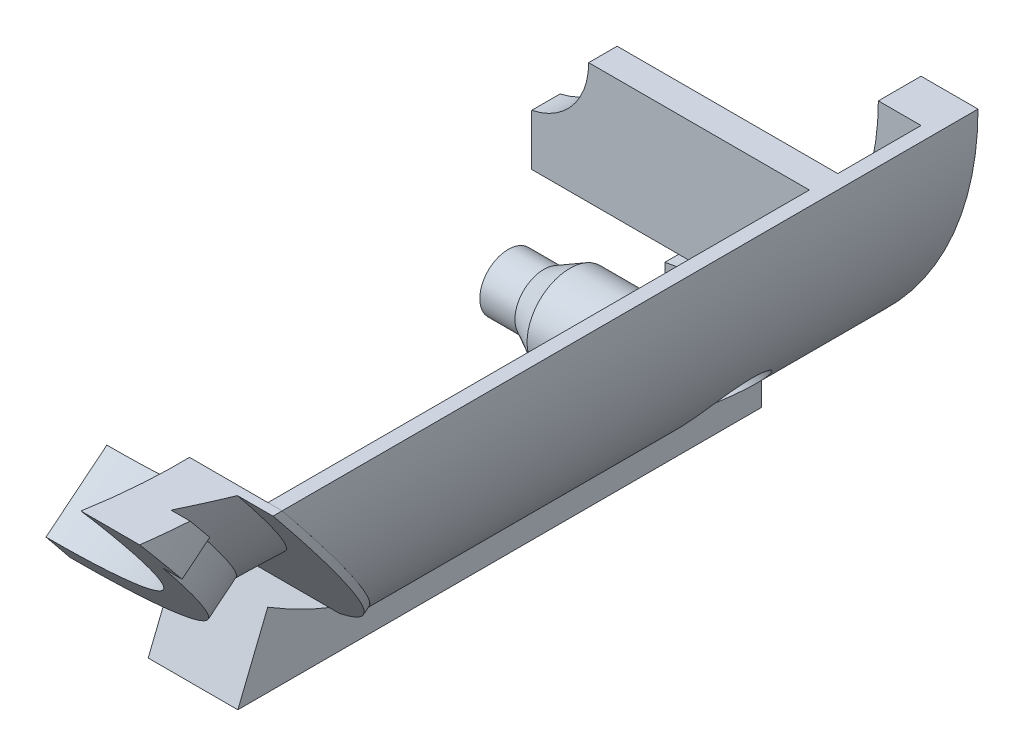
ISO-10303-21;
HEADER;
FILE_DESCRIPTION(('STEP AP214'),'2;1');
FILE_NAME('part.step','',(''),(''),'','','');
FILE_SCHEMA(('AUTOMOTIVE_DESIGN { 1 0 10303 214 1 1 1 1 }'));
ENDSEC;
DATA;
#1=APPLICATION_CONTEXT('core data for automotive mechanical design processes');
#2=APPLICATION_PROTOCOL_DEFINITION('international standard','automotive_design',2000,#1);
#3=PRODUCT_CONTEXT('',#1,'mechanical');
#4=PRODUCT('Part','Part','',(#3));
#5=PRODUCT_RELATED_PRODUCT_CATEGORY('part','',(#4));
#6=PRODUCT_DEFINITION_FORMATION('','',#4);
#7=PRODUCT_DEFINITION_CONTEXT('part definition',#1,'design');
#8=PRODUCT_DEFINITION('design','',#6,#7);
#9=PRODUCT_DEFINITION_SHAPE('','',#8);
#10=(LENGTH_UNIT() NAMED_UNIT(*) SI_UNIT(.MILLI.,.METRE.));
#11=(NAMED_UNIT(*) PLANE_ANGLE_UNIT() SI_UNIT($,.RADIAN.));
#12=(NAMED_UNIT(*) SI_UNIT($,.STERADIAN.) SOLID_ANGLE_UNIT());
#13=UNCERTAINTY_MEASURE_WITH_UNIT(LENGTH_MEASURE(1.E-05),#10,'distance_accuracy_value','');
#14=(GEOMETRIC_REPRESENTATION_CONTEXT(3) GLOBAL_UNCERTAINTY_ASSIGNED_CONTEXT((#13)) GLOBAL_UNIT_ASSIGNED_CONTEXT((#10,
#11,#12)) REPRESENTATION_CONTEXT('',''));
#15=CARTESIAN_POINT('',(0.,0.,0.));
#16=DIRECTION('',(0.,0.,1.));
#17=DIRECTION('',(1.,0.,0.));
#18=AXIS2_PLACEMENT_3D('',#15,#16,#17);
#19=CARTESIAN_POINT('',(0.,-1.57330097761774,49.470141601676));
#20=DIRECTION('',(0.,-0.629320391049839,0.77714596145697));
#21=DIRECTION('',(0.,-0.77714596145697,-0.629320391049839));
#22=AXIS2_PLACEMENT_3D('',#19,#20,#21);
#23=CYLINDRICAL_SURFACE('',#22,18.9999999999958);
#24=CARTESIAN_POINT('',(0.,-1.57330097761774,49.470141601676));
#25=DIRECTION('',(0.,-0.629320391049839,0.777145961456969));
#26=DIRECTION('',(0.,-0.777145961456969,-0.629320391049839));
#27=AXIS2_PLACEMENT_3D('',#24,#25,#26);
#28=CIRCLE('',#27,18.9999999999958);
#29=CARTESIAN_POINT('',(18.9999999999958,-1.57330097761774,49.470141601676));
#30=VERTEX_POINT('',#29);
#31=CARTESIAN_POINT('',(18.8918384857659,0.,50.7441756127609));
#32=VERTEX_POINT('',#31);
#33=EDGE_CURVE('E216',#30,#32,#28,.T.);
#34=ORIENTED_EDGE('',*,*,#33,.T.);
#35=CARTESIAN_POINT('',(0.,0.,47.527276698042));
#36=DIRECTION('',(0.,1.,0.));
#37=DIRECTION('',(0.,0.,1.));
#38=AXIS2_PLACEMENT_3D('',#35,#36,#37);
#39=ELLIPSE('',#38,30.1912988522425,18.9999999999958);
#40=CARTESIAN_POINT('',(18.5635730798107,0.,53.9610745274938));
#41=VERTEX_POINT('',#40);
#42=EDGE_CURVE('E223',#32,#41,#39,.F.);
#43=ORIENTED_EDGE('',*,*,#42,.T.);
#44=CARTESIAN_POINT('',(0.,-3.14660195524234,51.4130065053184));
#45=DIRECTION('',(0.,-0.629320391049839,0.777145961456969));
#46=DIRECTION('',(0.,-0.777145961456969,-0.629320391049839));
#47=AXIS2_PLACEMENT_3D('',#44,#45,#46);
#48=CIRCLE('',#47,18.9999999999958);
#49=CARTESIAN_POINT('',(18.9999999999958,-3.14660195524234,51.4130065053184));
#50=VERTEX_POINT('',#49);
#51=EDGE_CURVE('E247',#50,#41,#48,.T.);
#52=ORIENTED_EDGE('',*,*,#51,.F.);
#53=DIRECTION('',(0.,-0.629320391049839,0.77714596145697));
#54=VECTOR('',#53,1.);
#55=CARTESIAN_POINT('',(18.9999999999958,-1.57330097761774,49.470141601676));
#56=LINE('',#55,#54);
#57=EDGE_CURVE('E211',#30,#50,#56,.T.);
#58=ORIENTED_EDGE('',*,*,#57,.F.);
#59=EDGE_LOOP('',(#34,#43,#52,#58));
#60=FACE_BOUND('',#59,.T.);
#61=ADVANCED_FACE('F72',(#60),#23,.T.);
#62=CARTESIAN_POINT('',(0.,-1.57330097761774,49.470141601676));
#63=DIRECTION('',(0.,-0.629320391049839,0.777145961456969));
#64=DIRECTION('',(0.,-0.777145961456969,-0.629320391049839));
#65=AXIS2_PLACEMENT_3D('',#62,#63,#64);
#66=PLANE('',#65);
#67=DIRECTION('',(-1.,0.,0.));
#68=VECTOR('',#67,1.);
#69=CARTESIAN_POINT('',(0.,0.,50.7441756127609));
#70=LINE('',#69,#68);
#71=CARTESIAN_POINT('',(17.5543764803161,0.,50.7441756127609));
#72=VERTEX_POINT('',#71);
#73=EDGE_CURVE('E222',#32,#72,#70,.T.);
#74=ORIENTED_EDGE('',*,*,#73,.F.);
#75=ORIENTED_EDGE('',*,*,#33,.F.);
#76=DIRECTION('',(1.,0.,0.));
#77=VECTOR('',#76,1.);
#78=CARTESIAN_POINT('',(18.9999999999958,-1.57330097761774,49.470141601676));
#79=LINE('',#78,#77);
#80=CARTESIAN_POINT('',(17.6707264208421,-1.57330097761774,49.470141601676));
#81=VERTEX_POINT('',#80);
#82=EDGE_CURVE('E208',#81,#30,#79,.T.);
#83=ORIENTED_EDGE('',*,*,#82,.F.);
#84=CARTESIAN_POINT('',(0.,-1.57330097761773,49.470141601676));
#85=DIRECTION('',(0.,-0.629320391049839,0.77714596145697));
#86=DIRECTION('',(0.,-0.77714596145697,-0.629320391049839));
#87=AXIS2_PLACEMENT_3D('',#84,#85,#86);
#88=CIRCLE('',#87,17.6707264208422);
#89=EDGE_CURVE('E82',#81,#72,#88,.T.);
#90=ORIENTED_EDGE('',*,*,#89,.T.);
#91=EDGE_LOOP('',(#74,#75,#83,#90));
#92=FACE_BOUND('',#91,.T.);
#93=ADVANCED_FACE('F214',(#92),#66,.F.);
#94=CARTESIAN_POINT('',(0.,-0.314660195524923,47.2724698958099));
#95=DIRECTION('',(0.,-0.629320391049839,0.77714596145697));
#96=DIRECTION('',(0.,-0.77714596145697,-0.629320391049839));
#97=AXIS2_PLACEMENT_3D('',#94,#95,#96);
#98=PLANE('',#97);
#99=CARTESIAN_POINT('',(0.,-0.314660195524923,47.2724698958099));
#100=DIRECTION('',(0.,-0.629320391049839,0.77714596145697));
#101=DIRECTION('',(0.,-0.77714596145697,-0.629320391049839));
#102=AXIS2_PLACEMENT_3D('',#99,#100,#101);
#103=ELLIPSE('',#102,27.6653306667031,21.5);
#104=CARTESIAN_POINT('',(10.903971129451,-18.844458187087,32.267335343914));
#105=VERTEX_POINT('',#104);
#106=CARTESIAN_POINT('',(21.497697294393,0.,47.527276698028));
#107=VERTEX_POINT('',#106);
#108=EDGE_CURVE('E177',#105,#107,#103,.T.);
#109=ORIENTED_EDGE('',*,*,#108,.T.);
#110=DIRECTION('',(-1.,0.,0.));
#111=VECTOR('',#110,1.);
#112=CARTESIAN_POINT('',(0.,0.,47.527276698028));
#113=LINE('',#112,#111);
#114=CARTESIAN_POINT('',(18.9999999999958,0.,47.527276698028));
#115=VERTEX_POINT('',#114);
#116=EDGE_CURVE('E154',#107,#115,#113,.T.);
#117=ORIENTED_EDGE('',*,*,#116,.T.);
#118=CARTESIAN_POINT('',(0.,6.86256607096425E-12,47.5272766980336));
#119=DIRECTION('',(0.,-0.629320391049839,0.77714596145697));
#120=DIRECTION('',(0.,-0.77714596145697,-0.629320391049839));
#121=AXIS2_PLACEMENT_3D('',#118,#119,#120);
#122=CIRCLE('',#121,18.9999999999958);
#123=CARTESIAN_POINT('',(0.,-14.7657732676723,35.5701892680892));
#124=VERTEX_POINT('',#123);
#125=EDGE_CURVE('E175',#124,#115,#122,.T.);
#126=ORIENTED_EDGE('',*,*,#125,.F.);
#127=DIRECTION('',(0.,0.77714596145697,0.629320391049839));
#128=VECTOR('',#127,1.);
#129=CARTESIAN_POINT('',(0.,-0.314660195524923,47.2724698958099));
#130=LINE('',#129,#128);
#131=CARTESIAN_POINT('',(0.,-18.844458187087,32.267335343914));
#132=VERTEX_POINT('',#131);
#133=EDGE_CURVE('E236',#132,#124,#130,.T.);
#134=ORIENTED_EDGE('',*,*,#133,.F.);
#135=DIRECTION('',(1.,0.,0.));
#136=VECTOR('',#135,1.);
#137=CARTESIAN_POINT('',(-10.903971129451,-18.844458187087,32.267335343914));
#138=LINE('',#137,#136);
#139=EDGE_CURVE('E185',#132,#105,#138,.T.);
#140=ORIENTED_EDGE('',*,*,#139,.T.);
#141=EDGE_LOOP('',(#109,#117,#126,#134,#140));
#142=FACE_BOUND('',#141,.T.);
#143=ADVANCED_FACE('F264',(#142),#98,.T.);
#144=DIRECTION('',(0.,0.629320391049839,-0.77714596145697));
#145=VECTOR('',#144,1.);
#146=SURFACE_OF_LINEAR_EXTRUSION('',#103,#145);
#147=CARTESIAN_POINT('',(21.497697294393,0.,47.527276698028));
#148=CARTESIAN_POINT('',(21.498464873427,0.,47.4200481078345));
#149=CARTESIAN_POINT('',(21.4990405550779,0.,47.3128188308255));
#150=CARTESIAN_POINT('',(21.4998081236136,0.,47.0983589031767));
#151=CARTESIAN_POINT('',(21.5000000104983,0.,46.9911282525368));
#152=CARTESIAN_POINT('',(21.5,0.,46.8838969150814));
#153=B_SPLINE_CURVE_WITH_KNOTS('',3,(#147,#148,#149,#150,#151,#152),.UNSPECIFIED.,.F.,.F.,(4,2,
4),(0.,0.321692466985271,0.643384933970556),.UNSPECIFIED.);
#154=CARTESIAN_POINT('',(21.5,0.,46.8838969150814));
#155=VERTEX_POINT('',#154);
#156=EDGE_CURVE('E151',#107,#155,#153,.T.);
#157=ORIENTED_EDGE('',*,*,#156,.F.);
#158=ORIENTED_EDGE('',*,*,#108,.F.);
#159=DIRECTION('',(0.,0.629320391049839,-0.77714596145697));
#160=VECTOR('',#159,1.);
#161=CARTESIAN_POINT('',(10.903971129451,-18.844458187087,32.267335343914));
#162=LINE('',#161,#160);
#163=CARTESIAN_POINT('',(10.903971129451,-18.5297979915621,31.8787623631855));
#164=VERTEX_POINT('',#163);
#165=EDGE_CURVE('E173',#105,#164,#162,.T.);
#166=ORIENTED_EDGE('',*,*,#165,.T.);
#167=CARTESIAN_POINT('',(0.,0.,46.8838969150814));
#168=DIRECTION('',(0.,-0.629320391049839,0.77714596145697));
#169=DIRECTION('',(0.,-0.77714596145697,-0.629320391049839));
#170=AXIS2_PLACEMENT_3D('',#167,#168,#169);
#171=ELLIPSE('',#170,27.6653306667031,21.5);
#172=EDGE_CURVE('E165',#164,#155,#171,.T.);
#173=ORIENTED_EDGE('',*,*,#172,.T.);
#174=EDGE_LOOP('',(#157,#158,#166,#173));
#175=FACE_BOUND('',#174,.T.);
#176=ADVANCED_FACE('F74',(#175),#146,.F.);
#177=CARTESIAN_POINT('',(0.,0.,46.8838969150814));
#178=DIRECTION('',(0.,-0.629320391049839,0.77714596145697));
#179=DIRECTION('',(0.,-0.77714596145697,-0.629320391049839));
#180=AXIS2_PLACEMENT_3D('',#177,#178,#179);
#181=PLANE('',#180);
#182=DIRECTION('',(-1.,0.,0.));
#183=VECTOR('',#182,1.);
#184=CARTESIAN_POINT('',(0.,0.,46.8838969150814));
#185=LINE('',#184,#183);
#186=CARTESIAN_POINT('',(14.9945344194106,0.,46.8838969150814));
#187=VERTEX_POINT('',#186);
#188=EDGE_CURVE('E88',#155,#187,#185,.T.);
#189=ORIENTED_EDGE('',*,*,#188,.F.);
#190=ORIENTED_EDGE('',*,*,#172,.F.);
#191=DIRECTION('',(1.,0.,0.));
#192=VECTOR('',#191,1.);
#193=CARTESIAN_POINT('',(-10.903971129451,-18.5297979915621,31.8787623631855));
#194=LINE('',#193,#192);
#195=CARTESIAN_POINT('',(0.,-18.5297979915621,31.8787623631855));
#196=VERTEX_POINT('',#195);
#197=EDGE_CURVE('E174',#196,#164,#194,.T.);
#198=ORIENTED_EDGE('',*,*,#197,.F.);
#199=DIRECTION('',(0.,0.77714596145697,0.629320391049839));
#200=VECTOR('',#199,1.);
#201=CARTESIAN_POINT('',(0.,0.,46.8838969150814));
#202=LINE('',#201,#200);
#203=CARTESIAN_POINT('',(0.,-11.3425292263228,37.6988978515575));
#204=VERTEX_POINT('',#203);
#205=EDGE_CURVE('E232',#196,#204,#202,.T.);
#206=ORIENTED_EDGE('',*,*,#205,.T.);
#207=CARTESIAN_POINT('',(0.,0.314660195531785,47.1387037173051));
#208=DIRECTION('',(0.,-0.629320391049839,0.77714596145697));
#209=DIRECTION('',(0.,-0.77714596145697,-0.629320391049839));
#210=AXIS2_PLACEMENT_3D('',#207,#208,#209);
#211=CIRCLE('',#210,15.);
#212=EDGE_CURVE('E168',#204,#187,#211,.T.);
#213=ORIENTED_EDGE('',*,*,#212,.T.);
#214=EDGE_LOOP('',(#189,#190,#198,#206,#213));
#215=FACE_BOUND('',#214,.T.);
#216=ADVANCED_FACE('F163',(#215),#181,.F.);
#217=CARTESIAN_POINT('',(0.,-1.57330097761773,49.470141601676));
#218=DIRECTION('',(0.,0.629320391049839,-0.77714596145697));
#219=DIRECTION('',(0.,0.77714596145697,0.629320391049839));
#220=AXIS2_PLACEMENT_3D('',#217,#218,#219);
#221=CONICAL_SURFACE('',#220,17.6707264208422,0.488692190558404);
#222=ORIENTED_EDGE('',*,*,#125,.T.);
#223=CARTESIAN_POINT('',(0.,0.,12.679467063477));
#224=DIRECTION('',(0.,1.,0.));
#225=DIRECTION('',(0.,0.,-1.));
#226=AXIS2_PLACEMENT_3D('',#223,#224,#225);
#227=ELLIPSE('',#226,53.0725959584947,25.1911426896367);
#228=EDGE_CURVE('E220',#115,#72,#227,.F.);
#229=ORIENTED_EDGE('',*,*,#228,.T.);
#230=ORIENTED_EDGE('',*,*,#89,.F.);
#231=CARTESIAN_POINT('',(0.,-15.3060346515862,38.3495931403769));
#232=VERTEX_POINT('',#231);
#233=EDGE_CURVE('E187',#232,#81,#88,.T.);
#234=ORIENTED_EDGE('',*,*,#233,.F.);
#235=DIRECTION('',(0.,0.190808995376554,-0.981627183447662));
#236=VECTOR('',#235,1.);
#237=CARTESIAN_POINT('',(0.,-22.4880107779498,75.2976572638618));
#238=LINE('',#237,#236);
#239=EDGE_CURVE('E235',#124,#232,#238,.F.);
#240=ORIENTED_EDGE('',*,*,#239,.F.);
#241=EDGE_LOOP('',(#222,#229,#230,#234,#240));
#242=FACE_BOUND('',#241,.T.);
#243=ADVANCED_FACE('F219',(#242),#221,.T.);
#244=CARTESIAN_POINT('',(0.,-3.14660195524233,51.4130065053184));
#245=DIRECTION('',(0.,-0.629320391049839,0.77714596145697));
#246=DIRECTION('',(0.,-0.77714596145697,-0.629320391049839));
#247=AXIS2_PLACEMENT_3D('',#244,#245,#246);
#248=PLANE('',#247);
#249=ORIENTED_EDGE('',*,*,#51,.T.);
#250=DIRECTION('',(-1.,0.,0.));
#251=VECTOR('',#250,1.);
#252=CARTESIAN_POINT('',(0.,0.,53.9610745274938));
#253=LINE('',#252,#251);
#254=CARTESIAN_POINT('',(14.4432075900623,0.,53.9610745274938));
#255=VERTEX_POINT('',#254);
#256=EDGE_CURVE('E169',#41,#255,#253,.T.);
#257=ORIENTED_EDGE('',*,*,#256,.T.);
#258=CARTESIAN_POINT('',(0.,-3.14660195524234,51.4130065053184));
#259=DIRECTION('',(0.,-0.629320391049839,0.777145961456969));
#260=DIRECTION('',(0.,-0.777145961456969,-0.629320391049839));
#261=AXIS2_PLACEMENT_3D('',#258,#259,#260);
#262=CIRCLE('',#261,15.);
#263=CARTESIAN_POINT('',(0.,-14.8037913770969,41.9732006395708));
#264=VERTEX_POINT('',#263);
#265=EDGE_CURVE('E238',#264,#255,#262,.T.);
#266=ORIENTED_EDGE('',*,*,#265,.F.);
#267=DIRECTION('',(0.,0.77714596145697,0.629320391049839));
#268=VECTOR('',#267,1.);
#269=CARTESIAN_POINT('',(0.,-3.14660195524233,51.4130065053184));
#270=LINE('',#269,#268);
#271=CARTESIAN_POINT('',(0.,-16.8793356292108,40.2924580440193));
#272=VERTEX_POINT('',#271);
#273=EDGE_CURVE('E96',#272,#264,#270,.T.);
#274=ORIENTED_EDGE('',*,*,#273,.F.);
#275=CARTESIAN_POINT('',(0.,-3.14660195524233,51.4130065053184));
#276=DIRECTION('',(0.,-0.629320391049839,0.77714596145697));
#277=DIRECTION('',(0.,-0.77714596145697,-0.629320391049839));
#278=AXIS2_PLACEMENT_3D('',#275,#276,#277);
#279=CIRCLE('',#278,17.6707264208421);
#280=CARTESIAN_POINT('',(17.6707264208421,-3.14660195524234,51.4130065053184));
#281=VERTEX_POINT('',#280);
#282=EDGE_CURVE('E180',#272,#281,#279,.T.);
#283=ORIENTED_EDGE('',*,*,#282,.T.);
#284=DIRECTION('',(1.,0.,0.));
#285=VECTOR('',#284,1.);
#286=CARTESIAN_POINT('',(18.9999999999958,-3.14660195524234,51.4130065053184));
#287=LINE('',#286,#285);
#288=EDGE_CURVE('E210',#281,#50,#287,.T.);
#289=ORIENTED_EDGE('',*,*,#288,.T.);
#290=EDGE_LOOP('',(#249,#257,#266,#274,#283,#289));
#291=FACE_BOUND('',#290,.T.);
#292=ADVANCED_FACE('F253',(#291),#248,.T.);
#293=CARTESIAN_POINT('',(0.,1.88796117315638,45.1958388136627));
#294=DIRECTION('',(0.,-0.629320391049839,0.77714596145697));
#295=DIRECTION('',(0.,-0.77714596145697,-0.629320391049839));
#296=AXIS2_PLACEMENT_3D('',#293,#294,#295);
#297=CYLINDRICAL_SURFACE('',#296,15.);
#298=CARTESIAN_POINT('',(0.,0.,47.527276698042));
#299=DIRECTION('',(0.,1.,0.));
#300=DIRECTION('',(0.,0.,1.));
#301=AXIS2_PLACEMENT_3D('',#298,#299,#300);
#302=ELLIPSE('',#301,23.8352359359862,15.);
#303=EDGE_CURVE('E13',#187,#255,#302,.F.);
#304=ORIENTED_EDGE('',*,*,#303,.F.);
#305=ORIENTED_EDGE('',*,*,#212,.F.);
#306=DIRECTION('',(0.,-0.629320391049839,0.77714596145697));
#307=VECTOR('',#306,1.);
#308=CARTESIAN_POINT('',(0.,-9.76922824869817,35.7560329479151));
#309=LINE('',#308,#307);
#310=EDGE_CURVE('E225',#204,#264,#309,.T.);
#311=ORIENTED_EDGE('',*,*,#310,.T.);
#312=ORIENTED_EDGE('',*,*,#265,.T.);
#313=EDGE_LOOP('',(#304,#305,#311,#312));
#314=FACE_BOUND('',#313,.T.);
#315=ADVANCED_FACE('F257',(#314),#297,.F.);
#316=CARTESIAN_POINT('',(-10.903971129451,-18.844458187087,32.267335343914));
#317=DIRECTION('',(0.,0.77714596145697,0.629320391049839));
#318=DIRECTION('',(0.,-0.629320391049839,0.77714596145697));
#319=AXIS2_PLACEMENT_3D('',#316,#317,#318);
#320=PLANE('',#319);
#321=ORIENTED_EDGE('',*,*,#139,.F.);
#322=DIRECTION('',(0.,0.629320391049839,-0.77714596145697));
#323=VECTOR('',#322,1.);
#324=CARTESIAN_POINT('',(0.,-18.844458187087,32.267335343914));
#325=LINE('',#324,#323);
#326=EDGE_CURVE('E234',#132,#196,#325,.T.);
#327=ORIENTED_EDGE('',*,*,#326,.T.);
#328=ORIENTED_EDGE('',*,*,#197,.T.);
#329=ORIENTED_EDGE('',*,*,#165,.F.);
#330=EDGE_LOOP('',(#321,#327,#328,#329));
#331=FACE_BOUND('',#330,.T.);
#332=ADVANCED_FACE('F261',(#331),#320,.F.);
#333=CARTESIAN_POINT('',(0.,-3.14660195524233,51.4130065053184));
#334=DIRECTION('',(0.,0.629320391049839,-0.77714596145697));
#335=DIRECTION('',(0.,0.77714596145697,0.629320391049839));
#336=AXIS2_PLACEMENT_3D('',#333,#334,#335);
#337=CYLINDRICAL_SURFACE('',#336,17.6707264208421);
#338=ORIENTED_EDGE('',*,*,#282,.F.);
#339=DIRECTION('',(0.,0.629320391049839,-0.77714596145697));
#340=VECTOR('',#339,1.);
#341=CARTESIAN_POINT('',(0.,-16.8793356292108,40.2924580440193));
#342=LINE('',#341,#340);
#343=EDGE_CURVE('E201',#272,#232,#342,.T.);
#344=ORIENTED_EDGE('',*,*,#343,.T.);
#345=ORIENTED_EDGE('',*,*,#233,.T.);
#346=DIRECTION('',(0.,-0.629320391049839,0.77714596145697));
#347=VECTOR('',#346,1.);
#348=CARTESIAN_POINT('',(17.6707264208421,-1.57330097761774,49.470141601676));
#349=LINE('',#348,#347);
#350=EDGE_CURVE('E200',#81,#281,#349,.T.);
#351=ORIENTED_EDGE('',*,*,#350,.T.);
#352=EDGE_LOOP('',(#338,#344,#345,#351));
#353=FACE_BOUND('',#352,.T.);
#354=ADVANCED_FACE('F199',(#353),#337,.T.);
#355=CARTESIAN_POINT('',(18.9999999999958,-1.57330097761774,49.470141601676));
#356=DIRECTION('',(0.,-0.77714596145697,-0.629320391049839));
#357=DIRECTION('',(0.,0.629320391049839,-0.77714596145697));
#358=AXIS2_PLACEMENT_3D('',#355,#356,#357);
#359=PLANE('',#358);
#360=ORIENTED_EDGE('',*,*,#288,.F.);
#361=ORIENTED_EDGE('',*,*,#350,.F.);
#362=ORIENTED_EDGE('',*,*,#82,.T.);
#363=ORIENTED_EDGE('',*,*,#57,.T.);
#364=EDGE_LOOP('',(#360,#361,#362,#363));
#365=FACE_BOUND('',#364,.T.);
#366=ADVANCED_FACE('F207',(#365),#359,.T.);
#367=CARTESIAN_POINT('',(0.,-27.743431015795,66.6356900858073));
#368=DIRECTION('',(1.,0.,0.));
#369=DIRECTION('',(0.,0.,-1.));
#370=AXIS2_PLACEMENT_3D('',#367,#368,#369);
#371=PLANE('',#370);
#372=ORIENTED_EDGE('',*,*,#133,.T.);
#373=ORIENTED_EDGE('',*,*,#239,.T.);
#374=ORIENTED_EDGE('',*,*,#343,.F.);
#375=ORIENTED_EDGE('',*,*,#273,.T.);
#376=ORIENTED_EDGE('',*,*,#310,.F.);
#377=ORIENTED_EDGE('',*,*,#205,.F.);
#378=ORIENTED_EDGE('',*,*,#326,.F.);
#379=EDGE_LOOP('',(#372,#373,#374,#375,#376,#377,#378));
#380=FACE_BOUND('',#379,.T.);
#381=ADVANCED_FACE('F258',(#380),#371,.F.);
#382=CARTESIAN_POINT('',(21.5,0.,67.2372970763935));
#383=DIRECTION('',(0.,1.,0.));
#384=DIRECTION('',(0.,0.,1.));
#385=AXIS2_PLACEMENT_3D('',#382,#383,#384);
#386=PLANE('',#385);
#387=ORIENTED_EDGE('',*,*,#73,.T.);
#388=ORIENTED_EDGE('',*,*,#228,.F.);
#389=ORIENTED_EDGE('',*,*,#116,.F.);
#390=ORIENTED_EDGE('',*,*,#156,.T.);
#391=ORIENTED_EDGE('',*,*,#188,.T.);
#392=ORIENTED_EDGE('',*,*,#303,.T.);
#393=ORIENTED_EDGE('',*,*,#256,.F.);
#394=ORIENTED_EDGE('',*,*,#42,.F.);
#395=EDGE_LOOP('',(#387,#388,#389,#390,#391,#392,#393,#394));
#396=FACE_BOUND('',#395,.T.);
#397=ADVANCED_FACE('F152',(#396),#386,.T.);
#398=CLOSED_SHELL('',(#61,#93,#143,#176,#216,#243,#292,#315,#332,#354,#366,#381,#397));
#399=MANIFOLD_SOLID_BREP('B2',#398);
#400=CARTESIAN_POINT('',(0.,0.,65.));
#401=DIRECTION('',(0.,0.,-1.));
#402=DIRECTION('',(-1.,0.,0.));
#403=AXIS2_PLACEMENT_3D('',#400,#401,#402);
#404=CYLINDRICAL_SURFACE('',#403,20.5);
#405=CARTESIAN_POINT('',(13.9378237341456,-15.0328663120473,13.0000000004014));
#406=CARTESIAN_POINT('',(14.1233960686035,-14.8608073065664,13.0000033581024));
#407=CARTESIAN_POINT('',(14.3058589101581,-14.6852176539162,12.9852408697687));
#408=CARTESIAN_POINT('',(14.661272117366,-14.3303871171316,12.9221470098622));
#409=CARTESIAN_POINT('',(14.8342290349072,-14.1511488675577,12.8738390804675));
#410=CARTESIAN_POINT('',(15.142772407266,-13.8199180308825,12.7487159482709));
#411=CARTESIAN_POINT('',(15.2801595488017,-13.6677074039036,12.676987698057));
#412=CARTESIAN_POINT('',(15.5416705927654,-13.3695777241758,12.5026364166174));
#413=CARTESIAN_POINT('',(15.6658096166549,-13.2236516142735,12.4000491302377));
#414=CARTESIAN_POINT('',(15.8745472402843,-12.9719020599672,12.1850284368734));
#415=CARTESIAN_POINT('',(15.9621630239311,-12.8637550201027,12.0782570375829));
#416=CARTESIAN_POINT('',(16.123570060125,-12.6608553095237,11.8432488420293));
#417=CARTESIAN_POINT('',(16.1973647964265,-12.5660992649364,11.7150174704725));
#418=CARTESIAN_POINT('',(16.2958241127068,-12.4378091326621,11.5074527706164));
#419=CARTESIAN_POINT('',(16.3267283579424,-12.3971853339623,11.4353289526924));
#420=CARTESIAN_POINT('',(16.3839595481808,-12.3214492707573,11.2865348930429));
#421=CARTESIAN_POINT('',(16.4102889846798,-12.2863340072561,11.2098671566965));
#422=CARTESIAN_POINT('',(16.4580434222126,-12.2222915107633,11.0525564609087));
#423=CARTESIAN_POINT('',(16.4794707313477,-12.193361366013,10.9719153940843));
#424=CARTESIAN_POINT('',(16.5171530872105,-12.142267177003,10.8073842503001));
#425=CARTESIAN_POINT('',(16.5334091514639,-12.120101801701,10.7234948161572));
#426=CARTESIAN_POINT('',(16.5700300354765,-12.0700332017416,10.4934771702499));
#427=CARTESIAN_POINT('',(16.5852909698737,-12.0489942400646,10.3449307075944));
#428=CARTESIAN_POINT('',(16.5994588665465,-12.0294687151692,10.0457122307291));
#429=CARTESIAN_POINT('',(16.5983750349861,-12.0309694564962,9.89504146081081));
#430=CARTESIAN_POINT('',(16.5807302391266,-12.0552710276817,9.60914820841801));
#431=CARTESIAN_POINT('',(16.5654714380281,-12.0762797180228,9.47368771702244));
#432=CARTESIAN_POINT('',(16.5218675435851,-12.1358659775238,9.2089208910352));
#433=CARTESIAN_POINT('',(16.4935229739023,-12.1744428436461,9.07961431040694));
#434=CARTESIAN_POINT('',(16.423926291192,-12.2681743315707,8.82740174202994));
#435=CARTESIAN_POINT('',(16.3824001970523,-12.3236797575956,8.70470303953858));
#436=CARTESIAN_POINT('',(16.2879544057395,-12.4482384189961,8.47119911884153));
#437=CARTESIAN_POINT('',(16.2350313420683,-12.5172956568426,8.36039742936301));
#438=CARTESIAN_POINT('',(16.1128733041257,-12.6742339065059,8.1406972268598));
#439=CARTESIAN_POINT('',(16.0424890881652,-12.7633462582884,8.03332271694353));
#440=CARTESIAN_POINT('',(15.8913408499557,-12.9510564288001,7.83558446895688));
#441=CARTESIAN_POINT('',(15.8105699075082,-13.0496605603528,7.7452321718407));
#442=CARTESIAN_POINT('',(15.5992829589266,-13.3022859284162,7.54183324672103));
#443=CARTESIAN_POINT('',(15.463565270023,-13.4600954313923,7.43886278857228));
#444=CARTESIAN_POINT('',(15.1778458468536,-13.7814890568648,7.26734955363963));
#445=CARTESIAN_POINT('',(15.0278161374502,-13.9450840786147,7.198875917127));
#446=CARTESIAN_POINT('',(14.7677405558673,-14.2192550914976,7.11009547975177));
#447=CARTESIAN_POINT('',(14.6604598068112,-14.3298631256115,7.08137269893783));
#448=CARTESIAN_POINT('',(14.4420446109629,-14.5499609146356,7.03699310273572));
#449=CARTESIAN_POINT('',(14.3309088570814,-14.6594502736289,7.02134076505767));
#450=CARTESIAN_POINT('',(14.1054788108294,-14.876491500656,7.00209486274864));
#451=CARTESIAN_POINT('',(13.9911802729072,-14.9840404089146,6.99851838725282));
#452=CARTESIAN_POINT('',(13.7602698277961,-15.1963674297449,7.00257757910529));
#453=CARTESIAN_POINT('',(13.6436579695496,-15.3011456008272,7.01021300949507));
#454=CARTESIAN_POINT('',(13.3773439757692,-15.5349888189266,7.03938746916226));
#455=CARTESIAN_POINT('',(13.2271196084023,-15.6630692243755,7.06409434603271));
#456=CARTESIAN_POINT('',(12.925042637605,-15.9132575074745,7.12917632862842));
#457=CARTESIAN_POINT('',(12.7731894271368,-16.0353630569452,7.16955748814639));
#458=CARTESIAN_POINT('',(12.4690633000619,-16.2729745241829,7.26530792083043));
#459=CARTESIAN_POINT('',(12.316790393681,-16.3884806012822,7.32067683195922));
#460=CARTESIAN_POINT('',(12.0131634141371,-16.6123276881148,7.44622362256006));
#461=CARTESIAN_POINT('',(11.8618089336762,-16.7206721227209,7.51639435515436));
#462=CARTESIAN_POINT('',(11.617022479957,-16.8910667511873,7.64334117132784));
#463=CARTESIAN_POINT('',(11.5228112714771,-16.9554562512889,7.69551565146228));
#464=CARTESIAN_POINT('',(11.3359800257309,-17.0809310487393,7.80627343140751));
#465=CARTESIAN_POINT('',(11.2433596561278,-17.1420170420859,7.86485537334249));
#466=CARTESIAN_POINT('',(11.0605980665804,-17.2605042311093,7.98878909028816));
#467=CARTESIAN_POINT('',(10.9704527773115,-17.317911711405,8.05412879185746));
#468=CARTESIAN_POINT('',(10.7935529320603,-17.4287148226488,8.1923086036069));
#469=CARTESIAN_POINT('',(10.706796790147,-17.4821123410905,8.26514514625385));
#470=CARTESIAN_POINT('',(10.5245403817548,-17.5925304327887,8.43166737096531));
#471=CARTESIAN_POINT('',(10.4298789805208,-17.6487517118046,8.52682205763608));
#472=CARTESIAN_POINT('',(10.2507994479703,-17.7533603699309,8.73035926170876));
#473=CARTESIAN_POINT('',(10.1663709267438,-17.8017557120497,8.83872813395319));
#474=CARTESIAN_POINT('',(10.0351618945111,-17.8759492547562,9.03831303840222));
#475=CARTESIAN_POINT('',(9.98443493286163,-17.9042917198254,9.12594694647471));
#476=CARTESIAN_POINT('',(9.89518972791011,-17.9537690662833,9.30914582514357));
#477=CARTESIAN_POINT('',(9.85664823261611,-17.9749176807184,9.4046952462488));
#478=CARTESIAN_POINT('',(9.80200372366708,-18.0047633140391,9.5825749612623));
#479=CARTESIAN_POINT('',(9.78294904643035,-18.015107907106,9.66370691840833));
#480=CARTESIAN_POINT('',(9.75714865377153,-18.0290952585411,9.82846433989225));
#481=CARTESIAN_POINT('',(9.75039114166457,-18.0327444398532,9.91208733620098));
#482=CARTESIAN_POINT('',(9.74995126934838,-18.0329823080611,10.0795138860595));
#483=CARTESIAN_POINT('',(9.75628990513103,-18.0295596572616,10.1633175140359));
#484=CARTESIAN_POINT('',(9.78133816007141,-18.0159822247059,10.3284967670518));
#485=CARTESIAN_POINT('',(9.80005934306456,-18.0058211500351,10.4098700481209));
#486=CARTESIAN_POINT('',(9.85514177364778,-17.975745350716,10.5918662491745));
#487=CARTESIAN_POINT('',(9.89508406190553,-17.9538339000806,10.6910580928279));
#488=CARTESIAN_POINT('',(9.98801543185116,-17.9023002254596,10.8809631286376));
#489=CARTESIAN_POINT('',(10.0410345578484,-17.872660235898,10.9716561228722));
#490=CARTESIAN_POINT('',(10.1459222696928,-17.8132880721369,11.1291650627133));
#491=CARTESIAN_POINT('',(10.1963133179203,-17.7845129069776,11.1973564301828));
#492=CARTESIAN_POINT('',(10.3017476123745,-17.7236481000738,11.3285044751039));
#493=CARTESIAN_POINT('',(10.3567939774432,-17.6915562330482,11.3914575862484));
#494=CARTESIAN_POINT('',(10.4704563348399,-17.6245257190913,11.5126484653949));
#495=CARTESIAN_POINT('',(10.5290787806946,-17.5895818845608,11.5708772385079));
#496=CARTESIAN_POINT('',(10.6489799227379,-17.5172526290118,11.6829346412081));
#497=CARTESIAN_POINT('',(10.7102595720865,-17.4798663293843,11.7367616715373));
#498=CARTESIAN_POINT('',(10.8855021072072,-17.3716268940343,11.8825303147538));
#499=CARTESIAN_POINT('',(11.0017763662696,-17.2982858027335,11.9698640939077));
#500=CARTESIAN_POINT('',(11.2384218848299,-17.1454884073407,12.1329095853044));
#501=CARTESIAN_POINT('',(11.35879618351,-17.066027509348,12.2086124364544));
#502=CARTESIAN_POINT('',(11.6021982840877,-16.9014971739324,12.3494593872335));
#503=CARTESIAN_POINT('',(11.7252301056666,-16.8164187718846,12.4145860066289));
#504=CARTESIAN_POINT('',(11.9725871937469,-16.6412179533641,12.5346550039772));
#505=CARTESIAN_POINT('',(12.0969121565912,-16.5510967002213,12.5895997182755));
#506=CARTESIAN_POINT('',(12.3661764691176,-16.3511512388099,12.6975989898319));
#507=CARTESIAN_POINT('',(12.5112003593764,-16.2404965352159,12.7489131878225));
#508=CARTESIAN_POINT('',(12.8008116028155,-16.0132172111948,12.8379230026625));
#509=CARTESIAN_POINT('',(12.9453988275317,-15.8965909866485,12.8756149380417));
#510=CARTESIAN_POINT('',(13.2328438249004,-15.6581172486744,12.9366954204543));
#511=CARTESIAN_POINT('',(13.3757043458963,-15.5362800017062,12.9601108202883));
#512=CARTESIAN_POINT('',(13.6588952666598,-15.2879056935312,12.9917585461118));
#513=CARTESIAN_POINT('',(13.7992267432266,-15.1613707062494,12.999997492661));
#514=CARTESIAN_POINT('',(13.9378237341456,-15.0328663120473,13.0000000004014));
#515=B_SPLINE_CURVE_WITH_KNOTS('',3,(#405,#406,#407,#408,#409,#410,#411,#412,#413,#414,#415,
#416,#417,#418,#419,#420,#421,#422,#423,#424,#425,#426,#427,#428,#429,#430,#431,#432,#433,#434,
#435,#436,#437,#438,#439,#440,#441,#442,#443,#444,#445,#446,#447,#448,#449,#450,#451,#452,#453,
#454,#455,#456,#457,#458,#459,#460,#461,#462,#463,#464,#465,#466,#467,#468,#469,#470,#471,#472,
#473,#474,#475,#476,#477,#478,#479,#480,#481,#482,#483,#484,#485,#486,#487,#488,#489,#490,#491,
#492,#493,#494,#495,#496,#497,#498,#499,#500,#501,#502,#503,#504,#505,#506,#507,#508,#509,#510,
#511,#512,#513,#514),.UNSPECIFIED.,.T.,.F.,(4,2,2,2,2,2,2,2,2,2,2,2,2,2,2,2,2,2,2,2,2,2,2,2,2,2,
2,2,2,2,2,2,2,2,2,2,2,2,2,2,2,2,2,2,2,2,2,2,2,2,2,2,2,2,4),(0.,0.758817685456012,
1.51710562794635,2.16655437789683,2.81525373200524,3.33953757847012,3.86368909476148,
4.12842490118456,4.39301607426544,4.65748241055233,4.92189667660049,5.37160697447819,
5.82106398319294,6.23292629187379,6.64477212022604,7.06581054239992,7.48697350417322,
7.95404520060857,8.42142971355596,9.11426640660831,9.80848624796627,10.2781387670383,
10.7479521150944,11.2184300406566,11.6888980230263,12.2849765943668,12.881285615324,
13.4775802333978,14.0735875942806,14.4498280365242,14.8259888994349,15.2014889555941,
15.5768111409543,16.0125183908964,16.4477794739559,16.7622864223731,17.076189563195,
17.3270594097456,17.5776884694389,17.8287196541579,18.0799856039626,18.4056207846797,
18.7320112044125,19.000258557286,19.2686870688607,19.5376152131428,19.8066406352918,
20.2944762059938,20.7826816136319,21.2716858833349,21.7605778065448,22.3284759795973,
22.8965275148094,23.4635072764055,24.0302396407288),.UNSPECIFIED.);
#516=CARTESIAN_POINT('',(13.9378237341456,-15.0328663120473,13.0000000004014));
#517=VERTEX_POINT('',#516);
#518=EDGE_CURVE('E582',#517,#517,#515,.T.);
#519=ORIENTED_EDGE('',*,*,#518,.F.);
#520=EDGE_LOOP('',(#519));
#521=FACE_BOUND('',#520,.T.);
#522=CARTESIAN_POINT('',(0.,0.,46.8838969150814));
#523=DIRECTION('',(0.,0.629320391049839,-0.77714596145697));
#524=DIRECTION('',(0.,-0.77714596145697,-0.629320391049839));
#525=AXIS2_PLACEMENT_3D('',#522,#523,#524);
#526=ELLIPSE('',#525,26.37857110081,20.5);
#527=CARTESIAN_POINT('',(20.5,0.,46.8838969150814));
#528=VERTEX_POINT('',#527);
#529=CARTESIAN_POINT('',(8.76906987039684,-18.5297979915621,31.8787623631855));
#530=VERTEX_POINT('',#529);
#531=EDGE_CURVE('E547',#528,#530,#526,.T.);
#532=ORIENTED_EDGE('',*,*,#531,.F.);
#533=DIRECTION('',(0.,0.,-1.));
#534=VECTOR('',#533,1.);
#535=CARTESIAN_POINT('',(20.5,0.,65.));
#536=LINE('',#535,#534);
#537=CARTESIAN_POINT('',(20.5,0.,8.85));
#538=VERTEX_POINT('',#537);
#539=EDGE_CURVE('E528',#528,#538,#536,.T.);
#540=ORIENTED_EDGE('',*,*,#539,.T.);
#541=CARTESIAN_POINT('',(0.,0.,8.85));
#542=DIRECTION('',(0.,0.,-1.));
#543=DIRECTION('',(-1.,0.,0.));
#544=AXIS2_PLACEMENT_3D('',#541,#542,#543);
#545=CIRCLE('',#544,20.5);
#546=CARTESIAN_POINT('',(18.6547581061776,-8.5,8.85));
#547=VERTEX_POINT('',#546);
#548=EDGE_CURVE('E564',#538,#547,#545,.T.);
#549=ORIENTED_EDGE('',*,*,#548,.T.);
#550=DIRECTION('',(0.,0.,-1.));
#551=VECTOR('',#550,1.);
#552=CARTESIAN_POINT('',(18.6547581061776,-8.5,65.));
#553=LINE('',#552,#551);
#554=CARTESIAN_POINT('',(18.6547581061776,-8.5,5.05));
#555=VERTEX_POINT('',#554);
#556=EDGE_CURVE('E563',#555,#547,#553,.F.);
#557=ORIENTED_EDGE('',*,*,#556,.F.);
#558=CARTESIAN_POINT('',(0.,0.,5.05));
#559=DIRECTION('',(0.,0.,-1.));
#560=DIRECTION('',(-1.,0.,0.));
#561=AXIS2_PLACEMENT_3D('',#558,#559,#560);
#562=CIRCLE('',#561,20.5);
#563=CARTESIAN_POINT('',(19.0787840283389,-7.5,5.05));
#564=VERTEX_POINT('',#563);
#565=EDGE_CURVE('E625',#564,#555,#562,.T.);
#566=ORIENTED_EDGE('',*,*,#565,.F.);
#567=DIRECTION('',(0.,0.,1.));
#568=VECTOR('',#567,1.);
#569=CARTESIAN_POINT('',(19.0787840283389,-7.5,5.05));
#570=LINE('',#569,#568);
#571=CARTESIAN_POINT('',(19.0787840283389,-7.5,6.85));
#572=VERTEX_POINT('',#571);
#573=EDGE_CURVE('E633',#564,#572,#570,.T.);
#574=ORIENTED_EDGE('',*,*,#573,.T.);
#575=CARTESIAN_POINT('',(0.,0.,6.85));
#576=DIRECTION('',(0.,0.,-1.));
#577=DIRECTION('',(-1.,0.,0.));
#578=AXIS2_PLACEMENT_3D('',#575,#576,#577);
#579=CIRCLE('',#578,20.5);
#580=CARTESIAN_POINT('',(20.5,0.,6.85));
#581=VERTEX_POINT('',#580);
#582=EDGE_CURVE('E561',#581,#572,#579,.T.);
#583=ORIENTED_EDGE('',*,*,#582,.F.);
#584=CARTESIAN_POINT('',(20.5,0.,1.));
#585=VERTEX_POINT('',#584);
#586=EDGE_CURVE('E1090',#581,#585,#536,.T.);
#587=ORIENTED_EDGE('',*,*,#586,.T.);
#588=CARTESIAN_POINT('',(0.,0.,1.));
#589=DIRECTION('',(0.,0.,1.));
#590=DIRECTION('',(1.,0.,0.));
#591=AXIS2_PLACEMENT_3D('',#588,#589,#590);
#592=CIRCLE('',#591,20.5);
#593=CARTESIAN_POINT('',(5.30000000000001,-19.8030300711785,1.));
#594=VERTEX_POINT('',#593);
#595=EDGE_CURVE('E677',#594,#585,#592,.T.);
#596=ORIENTED_EDGE('',*,*,#595,.F.);
#597=DIRECTION('',(0.,0.,-1.));
#598=VECTOR('',#597,1.);
#599=CARTESIAN_POINT('',(5.30000000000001,-19.8030300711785,31.3146467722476));
#600=LINE('',#599,#598);
#601=CARTESIAN_POINT('',(5.30000000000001,-19.8030300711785,31.3146467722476));
#602=VERTEX_POINT('',#601);
#603=EDGE_CURVE('E673',#602,#594,#600,.T.);
#604=ORIENTED_EDGE('',*,*,#603,.F.);
#605=CARTESIAN_POINT('',(0.,0.,23.3137032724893));
#606=DIRECTION('',(0.,0.374606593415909,0.927183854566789));
#607=DIRECTION('',(0.,0.927183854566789,-0.374606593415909));
#608=AXIS2_PLACEMENT_3D('',#605,#606,#607);
#609=ELLIPSE('',#608,22.1099622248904,20.5);
#610=CARTESIAN_POINT('',(6.57096986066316,-19.4183509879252,31.159226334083));
#611=VERTEX_POINT('',#610);
#612=EDGE_CURVE('E662',#602,#611,#609,.T.);
#613=ORIENTED_EDGE('',*,*,#612,.T.);
#614=EDGE_CURVE('E552',#530,#611,#526,.T.);
#615=ORIENTED_EDGE('',*,*,#614,.F.);
#616=EDGE_LOOP('',(#532,#540,#549,#557,#566,#574,#583,#587,#596,#604,#613,#615));
#617=FACE_BOUND('',#616,.T.);
#618=ADVANCED_FACE('F379',(#521,#617),#404,.F.);
#619=CARTESIAN_POINT('',(0.,0.,65.));
#620=DIRECTION('',(0.,0.,-1.));
#621=DIRECTION('',(-1.,0.,0.));
#622=AXIS2_PLACEMENT_3D('',#619,#620,#621);
#623=CYLINDRICAL_SURFACE('',#622,21.5);
#624=CARTESIAN_POINT('',(15.3708467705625,-15.0328663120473,7.25));
#625=CARTESIAN_POINT('',(15.2618176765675,-15.1443472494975,7.24999951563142));
#626=CARTESIAN_POINT('',(15.1515839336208,-15.2546269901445,7.25677039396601));
#627=CARTESIAN_POINT('',(14.9295247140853,-15.4720210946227,7.28308393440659));
#628=CARTESIAN_POINT('',(14.8176990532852,-15.5791350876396,7.30262808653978));
#629=CARTESIAN_POINT('',(14.5929360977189,-15.7898709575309,7.35401355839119));
#630=CARTESIAN_POINT('',(14.4799964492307,-15.8934811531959,7.38589230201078));
#631=CARTESIAN_POINT('',(14.2542179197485,-16.0962816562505,7.46162209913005));
#632=CARTESIAN_POINT('',(14.1413790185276,-16.1954733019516,7.50546949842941));
#633=CARTESIAN_POINT('',(13.9345713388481,-16.3735543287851,7.59720340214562));
#634=CARTESIAN_POINT('',(13.8404491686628,-16.4531678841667,7.64334524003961));
#635=CARTESIAN_POINT('',(13.6536122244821,-16.608540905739,7.74426635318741));
#636=CARTESIAN_POINT('',(13.560897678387,-16.6842997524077,7.79904701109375));
#637=CARTESIAN_POINT('',(13.3780322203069,-16.8312795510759,7.917431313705));
#638=CARTESIAN_POINT('',(13.2878748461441,-16.9025126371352,7.98100977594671));
#639=CARTESIAN_POINT('',(13.1110907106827,-17.040006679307,8.11764110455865));
#640=CARTESIAN_POINT('',(13.0244617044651,-17.106270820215,8.19068781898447));
#641=CARTESIAN_POINT('',(12.8478875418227,-17.2393497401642,8.35494335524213));
#642=CARTESIAN_POINT('',(12.7584799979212,-17.3055542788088,8.44723866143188));
#643=CARTESIAN_POINT('',(12.5892003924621,-17.4290840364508,8.64564598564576));
#644=CARTESIAN_POINT('',(12.5093200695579,-17.4864169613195,8.75174586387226));
#645=CARTESIAN_POINT('',(12.3800226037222,-17.5781089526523,8.95417400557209));
#646=CARTESIAN_POINT('',(12.3277575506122,-17.614753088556,9.0476169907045));
#647=CARTESIAN_POINT('',(12.235796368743,-17.6787564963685,9.2434803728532));
#648=CARTESIAN_POINT('',(12.1960780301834,-17.7061321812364,9.34588449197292));
#649=CARTESIAN_POINT('',(12.1394225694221,-17.745009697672,9.53705435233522));
#650=CARTESIAN_POINT('',(12.1195335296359,-17.7585801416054,9.62451210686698));
#651=CARTESIAN_POINT('',(12.0922113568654,-17.7771963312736,9.80223373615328));
#652=CARTESIAN_POINT('',(12.0847673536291,-17.7822495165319,9.89249509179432));
#653=CARTESIAN_POINT('',(12.0831081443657,-17.7833770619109,10.0733507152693));
#654=CARTESIAN_POINT('',(12.088914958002,-17.7794364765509,10.1639452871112));
#655=CARTESIAN_POINT('',(12.1131717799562,-17.7629185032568,10.3426192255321));
#656=CARTESIAN_POINT('',(12.1316318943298,-17.7503342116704,10.4306965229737));
#657=CARTESIAN_POINT('',(12.1853388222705,-17.7135203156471,10.6232168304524));
#658=CARTESIAN_POINT('',(12.2235815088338,-17.6871992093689,10.7264128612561));
#659=CARTESIAN_POINT('',(12.3129759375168,-17.6250840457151,10.9239527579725));
#660=CARTESIAN_POINT('',(12.3641528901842,-17.589271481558,11.0182788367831));
#661=CARTESIAN_POINT('',(12.504555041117,-17.4899037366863,11.2440125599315));
#662=CARTESIAN_POINT('',(12.5998053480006,-17.4215572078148,11.3695146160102));
#663=CARTESIAN_POINT('',(12.8031044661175,-17.272709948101,11.6014563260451));
#664=CARTESIAN_POINT('',(12.911184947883,-17.1921790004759,11.7078471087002));
#665=CARTESIAN_POINT('',(13.1122705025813,-17.0391013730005,11.8836600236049));
#666=CARTESIAN_POINT('',(13.2038851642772,-16.9682497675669,11.9562032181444));
#667=CARTESIAN_POINT('',(13.3904181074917,-16.8214385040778,12.0912841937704));
#668=CARTESIAN_POINT('',(13.4853382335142,-16.7454759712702,12.1538162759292));
#669=CARTESIAN_POINT('',(13.6773293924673,-16.5890329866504,12.2694292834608));
#670=CARTESIAN_POINT('',(13.7744022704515,-16.50854856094,12.3225017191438));
#671=CARTESIAN_POINT('',(13.9697141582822,-16.3436051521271,12.4194237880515));
#672=CARTESIAN_POINT('',(14.0679529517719,-16.2591468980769,12.4632751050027));
#673=CARTESIAN_POINT('',(14.2689846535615,-16.0830545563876,12.5434907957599));
#674=CARTESIAN_POINT('',(14.3717980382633,-15.9912681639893,12.5794710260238));
#675=CARTESIAN_POINT('',(14.5772391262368,-15.8042228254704,12.6414423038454));
#676=CARTESIAN_POINT('',(14.6798668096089,-15.7089635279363,12.667432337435));
#677=CARTESIAN_POINT('',(14.9863967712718,-15.4187116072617,12.7299798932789));
#678=CARTESIAN_POINT('',(15.18926085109,-15.2189700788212,12.7512404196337));
#679=CARTESIAN_POINT('',(15.5614971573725,-14.837512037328,12.7488121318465));
#680=CARTESIAN_POINT('',(15.7318579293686,-14.6567151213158,12.7304733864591));
#681=CARTESIAN_POINT('',(16.0624179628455,-14.2936565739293,12.6552457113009));
#682=CARTESIAN_POINT('',(16.2226287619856,-14.1113968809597,12.5984014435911));
#683=CARTESIAN_POINT('',(16.492667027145,-13.7940192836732,12.4597664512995));
#684=CARTESIAN_POINT('',(16.6055962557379,-13.6577180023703,12.3867450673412));
#685=CARTESIAN_POINT('',(16.8195754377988,-13.3933059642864,12.213421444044));
#686=CARTESIAN_POINT('',(16.9206409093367,-13.2651846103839,12.1131554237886));
#687=CARTESIAN_POINT('',(17.0902885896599,-13.0456005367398,11.9057112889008));
#688=CARTESIAN_POINT('',(17.1614280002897,-12.9517259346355,11.8031812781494));
#689=CARTESIAN_POINT('',(17.2914342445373,-12.7776402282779,11.5800015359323));
#690=CARTESIAN_POINT('',(17.3503041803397,-12.6974256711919,11.4593563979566));
#691=CARTESIAN_POINT('',(17.4278771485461,-12.5905153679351,11.2660700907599));
#692=CARTESIAN_POINT('',(17.4520275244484,-12.5569976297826,11.199270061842));
#693=CARTESIAN_POINT('',(17.4963799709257,-12.4951243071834,11.0620808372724));
#694=CARTESIAN_POINT('',(17.5165840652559,-12.466766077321,10.99169350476));
#695=CARTESIAN_POINT('',(17.5528003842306,-12.4157232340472,10.8478686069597));
#696=CARTESIAN_POINT('',(17.5688139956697,-12.3930367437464,10.7744320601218));
#697=CARTESIAN_POINT('',(17.5964554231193,-12.3537575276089,10.6251731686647));
#698=CARTESIAN_POINT('',(17.608083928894,-12.3371638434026,10.5493512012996));
#699=CARTESIAN_POINT('',(17.6336964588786,-12.3005534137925,10.3394061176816));
#700=CARTESIAN_POINT('',(17.6431017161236,-12.28702497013,10.2034939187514));
#701=CARTESIAN_POINT('',(17.6477459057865,-12.2803532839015,9.93103936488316));
#702=CARTESIAN_POINT('',(17.6429911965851,-12.2872008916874,9.79449732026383));
#703=CARTESIAN_POINT('',(17.6203229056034,-12.3196819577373,9.53391059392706));
#704=CARTESIAN_POINT('',(17.6032850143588,-12.3440650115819,9.40963057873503));
#705=CARTESIAN_POINT('',(17.5576538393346,-12.4088818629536,9.16758778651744));
#706=CARTESIAN_POINT('',(17.5290601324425,-12.4493162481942,9.04982524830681));
#707=CARTESIAN_POINT('',(17.4600891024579,-12.5458720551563,8.81954144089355));
#708=CARTESIAN_POINT('',(17.4193411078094,-12.6024841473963,8.70733867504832));
#709=CARTESIAN_POINT('',(17.3277442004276,-12.7281309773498,8.49468665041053));
#710=CARTESIAN_POINT('',(17.2768924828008,-12.7971691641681,8.39424066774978));
#711=CARTESIAN_POINT('',(17.1600139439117,-12.9535508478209,8.19535517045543));
#712=CARTESIAN_POINT('',(17.092912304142,-13.0420879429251,8.09849083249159));
#713=CARTESIAN_POINT('',(16.9495584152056,-13.2278604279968,7.92130540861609));
#714=CARTESIAN_POINT('',(16.8732982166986,-13.3251033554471,7.84099886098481));
#715=CARTESIAN_POINT('',(16.6758455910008,-13.5720786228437,7.66304812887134));
#716=CARTESIAN_POINT('',(16.5502941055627,-13.7251264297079,7.57480540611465));
#717=CARTESIAN_POINT('',(16.2873079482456,-14.0362116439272,7.43122163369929));
#718=CARTESIAN_POINT('',(16.1498605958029,-14.1942542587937,7.37591620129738));
#719=CARTESIAN_POINT('',(15.9056934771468,-14.4666039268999,7.30634428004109));
#720=CARTESIAN_POINT('',(15.8009467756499,-14.5809586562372,7.28496779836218));
#721=CARTESIAN_POINT('',(15.5881507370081,-14.8082325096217,7.25680065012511));
#722=CARTESIAN_POINT('',(15.4801035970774,-14.9211525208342,7.2500004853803));
#723=CARTESIAN_POINT('',(15.3708467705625,-15.0328663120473,7.25));
#724=B_SPLINE_CURVE_WITH_KNOTS('',3,(#624,#625,#626,#627,#628,#629,#630,#631,#632,#633,#634,
#635,#636,#637,#638,#639,#640,#641,#642,#643,#644,#645,#646,#647,#648,#649,#650,#651,#652,#653,
#654,#655,#656,#657,#658,#659,#660,#661,#662,#663,#664,#665,#666,#667,#668,#669,#670,#671,#672,
#673,#674,#675,#676,#677,#678,#679,#680,#681,#682,#683,#684,#685,#686,#687,#688,#689,#690,#691,
#692,#693,#694,#695,#696,#697,#698,#699,#700,#701,#702,#703,#704,#705,#706,#707,#708,#709,#710,
#711,#712,#713,#714,#715,#716,#717,#718,#719,#720,#721,#722,#723),.UNSPECIFIED.,.T.,.F.,(4,2,2,
2,2,2,2,2,2,2,2,2,2,2,2,2,2,2,2,2,2,2,2,2,2,2,2,2,2,2,2,2,2,2,2,2,2,2,2,2,2,2,2,2,2,2,2,2,2,4),
(0.,0.467636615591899,0.935327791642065,1.40444924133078,1.87342762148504,2.26799654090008,
2.66262867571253,3.05615373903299,3.4494243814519,3.88210444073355,4.3144065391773,
4.65278498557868,4.9905610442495,5.26153614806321,5.53227444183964,5.80346296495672,
6.07486833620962,6.41246033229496,6.75071548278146,7.26308731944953,7.77675129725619,
8.18619802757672,8.59587701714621,9.00592184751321,9.41589174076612,9.8427984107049,
10.2697483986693,11.1223515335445,11.8670100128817,12.6108062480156,13.1831715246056,
13.7547795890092,14.2214511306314,14.6880045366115,14.9233397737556,15.1585540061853,
15.3936902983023,15.6287895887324,16.0371338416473,16.4452947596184,16.8269170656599,
17.2085533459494,17.603284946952,17.9981262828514,18.4386258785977,18.8795106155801,
19.5261674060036,20.1735222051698,20.6424412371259,21.1110546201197),.UNSPECIFIED.);
#725=CARTESIAN_POINT('',(15.3708467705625,-15.0328663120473,7.25));
#726=VERTEX_POINT('',#725);
#727=EDGE_CURVE('E574',#726,#726,#724,.T.);
#728=ORIENTED_EDGE('',*,*,#727,.T.);
#729=EDGE_LOOP('',(#728));
#730=FACE_BOUND('',#729,.T.);
#731=DIRECTION('',(0.,0.,-1.));
#732=VECTOR('',#731,1.);
#733=CARTESIAN_POINT('',(21.5,0.,67.2372970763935));
#734=LINE('',#733,#732);
#735=CARTESIAN_POINT('',(21.5,0.,46.8838969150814));
#736=VERTEX_POINT('',#735);
#737=CARTESIAN_POINT('',(21.5,0.,-2.));
#738=VERTEX_POINT('',#737);
#739=EDGE_CURVE('E394',#736,#738,#734,.T.);
#740=ORIENTED_EDGE('',*,*,#739,.F.);
#741=CARTESIAN_POINT('',(0.,0.,46.8838969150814));
#742=DIRECTION('',(0.,0.629320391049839,-0.77714596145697));
#743=DIRECTION('',(0.,-0.77714596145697,-0.629320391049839));
#744=AXIS2_PLACEMENT_3D('',#741,#742,#743);
#745=ELLIPSE('',#744,27.6653306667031,21.5);
#746=CARTESIAN_POINT('',(10.903971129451,-18.5297979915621,31.8787623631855));
#747=VERTEX_POINT('',#746);
#748=EDGE_CURVE('E537',#736,#747,#745,.T.);
#749=ORIENTED_EDGE('',*,*,#748,.T.);
#750=CARTESIAN_POINT('',(0.,0.,24.3922380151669));
#751=DIRECTION('',(0.,0.374606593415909,0.927183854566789));
#752=DIRECTION('',(0.,0.927183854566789,-0.374606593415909));
#753=AXIS2_PLACEMENT_3D('',#750,#751,#752);
#754=ELLIPSE('',#753,23.188496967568,21.5);
#755=CARTESIAN_POINT('',(6.30000000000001,-20.5562642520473,32.6975078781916));
#756=VERTEX_POINT('',#755);
#757=EDGE_CURVE('E684',#756,#747,#754,.T.);
#758=ORIENTED_EDGE('',*,*,#757,.F.);
#759=DIRECTION('',(0.,0.,-1.));
#760=VECTOR('',#759,1.);
#761=CARTESIAN_POINT('',(6.30000000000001,-20.5562642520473,65.));
#762=LINE('',#761,#760);
#763=CARTESIAN_POINT('',(6.30000000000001,-20.5562642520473,-2.));
#764=VERTEX_POINT('',#763);
#765=EDGE_CURVE('E553',#756,#764,#762,.T.);
#766=ORIENTED_EDGE('',*,*,#765,.T.);
#767=CARTESIAN_POINT('',(0.,0.,-2.));
#768=DIRECTION('',(0.,0.,-1.));
#769=DIRECTION('',(-1.,0.,0.));
#770=AXIS2_PLACEMENT_3D('',#767,#768,#769);
#771=CIRCLE('',#770,21.5);
#772=EDGE_CURVE('E540',#738,#764,#771,.T.);
#773=ORIENTED_EDGE('',*,*,#772,.F.);
#774=EDGE_LOOP('',(#740,#749,#758,#766,#773));
#775=FACE_BOUND('',#774,.T.);
#776=ADVANCED_FACE('F535',(#730,#775),#623,.T.);
#777=CARTESIAN_POINT('',(0.,0.,6.85));
#778=DIRECTION('',(0.,0.,-1.));
#779=DIRECTION('',(-1.,0.,0.));
#780=AXIS2_PLACEMENT_3D('',#777,#778,#779);
#781=PLANE('',#780);
#782=CARTESIAN_POINT('',(0.,0.,6.85));
#783=DIRECTION('',(0.,0.,-1.));
#784=DIRECTION('',(-1.,0.,0.));
#785=AXIS2_PLACEMENT_3D('',#782,#783,#784);
#786=CIRCLE('',#785,5.);
#787=CARTESIAN_POINT('',(5.,0.,6.85));
#788=VERTEX_POINT('',#787);
#789=CARTESIAN_POINT('',(0.999999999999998,-4.89897948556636,6.85));
#790=VERTEX_POINT('',#789);
#791=EDGE_CURVE('E636',#788,#790,#786,.T.);
#792=ORIENTED_EDGE('',*,*,#791,.F.);
#793=DIRECTION('',(1.,0.,0.));
#794=VECTOR('',#793,1.);
#795=CARTESIAN_POINT('',(0.,0.,6.85));
#796=LINE('',#795,#794);
#797=EDGE_CURVE('E1087',#788,#581,#796,.T.);
#798=ORIENTED_EDGE('',*,*,#797,.T.);
#799=ORIENTED_EDGE('',*,*,#582,.T.);
#800=DIRECTION('',(1.,0.,0.));
#801=VECTOR('',#800,1.);
#802=CARTESIAN_POINT('',(19.0787840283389,-7.5,6.85));
#803=LINE('',#802,#801);
#804=CARTESIAN_POINT('',(0.999999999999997,-7.5,6.85));
#805=VERTEX_POINT('',#804);
#806=EDGE_CURVE('E622',#805,#572,#803,.T.);
#807=ORIENTED_EDGE('',*,*,#806,.F.);
#808=DIRECTION('',(0.,-1.,0.));
#809=VECTOR('',#808,1.);
#810=CARTESIAN_POINT('',(0.999999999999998,-4.89897948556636,6.85));
#811=LINE('',#810,#809);
#812=EDGE_CURVE('E638',#790,#805,#811,.T.);
#813=ORIENTED_EDGE('',*,*,#812,.F.);
#814=EDGE_LOOP('',(#792,#798,#799,#807,#813));
#815=FACE_BOUND('',#814,.T.);
#816=ADVANCED_FACE('F723',(#815),#781,.T.);
#817=CARTESIAN_POINT('',(-35.6405928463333,-18.5297979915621,31.8787623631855));
#818=DIRECTION('',(0.,0.629320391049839,-0.77714596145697));
#819=DIRECTION('',(0.,0.77714596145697,0.629320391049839));
#820=AXIS2_PLACEMENT_3D('',#817,#818,#819);
#821=PLANE('',#820);
#822=DIRECTION('',(1.,0.,0.));
#823=VECTOR('',#822,1.);
#824=CARTESIAN_POINT('',(-35.6405928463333,0.,46.8838969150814));
#825=LINE('',#824,#823);
#826=EDGE_CURVE('E525',#528,#736,#825,.T.);
#827=ORIENTED_EDGE('',*,*,#826,.F.);
#828=ORIENTED_EDGE('',*,*,#531,.T.);
#829=DIRECTION('',(1.,0.,0.));
#830=VECTOR('',#829,1.);
#831=CARTESIAN_POINT('',(10.,-18.5297979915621,31.8787623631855));
#832=LINE('',#831,#830);
#833=EDGE_CURVE('E545',#530,#747,#832,.T.);
#834=ORIENTED_EDGE('',*,*,#833,.T.);
#835=ORIENTED_EDGE('',*,*,#748,.F.);
#836=EDGE_LOOP('',(#827,#828,#834,#835));
#837=FACE_BOUND('',#836,.T.);
#838=ADVANCED_FACE('F543',(#837),#821,.F.);
#839=CARTESIAN_POINT('',(0.,0.,1.));
#840=DIRECTION('',(0.,0.,1.));
#841=DIRECTION('',(1.,0.,0.));
#842=AXIS2_PLACEMENT_3D('',#839,#840,#841);
#843=PLANE('',#842);
#844=ORIENTED_EDGE('',*,*,#595,.T.);
#845=DIRECTION('',(-1.,0.,0.));
#846=VECTOR('',#845,1.);
#847=CARTESIAN_POINT('',(0.,0.,1.));
#848=LINE('',#847,#846);
#849=CARTESIAN_POINT('',(17.5,0.,1.));
#850=VERTEX_POINT('',#849);
#851=EDGE_CURVE('E1093',#585,#850,#848,.T.);
#852=ORIENTED_EDGE('',*,*,#851,.T.);
#853=CARTESIAN_POINT('',(0.,0.,1.));
#854=DIRECTION('',(0.,0.,1.));
#855=DIRECTION('',(1.,0.,0.));
#856=AXIS2_PLACEMENT_3D('',#853,#854,#855);
#857=CIRCLE('',#856,17.5);
#858=CARTESIAN_POINT('',(2.5,-17.3205080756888,1.));
#859=VERTEX_POINT('',#858);
#860=EDGE_CURVE('E654',#859,#850,#857,.T.);
#861=ORIENTED_EDGE('',*,*,#860,.F.);
#862=DIRECTION('',(0.,1.,0.));
#863=VECTOR('',#862,1.);
#864=CARTESIAN_POINT('',(2.5,0.,1.));
#865=LINE('',#864,#863);
#866=CARTESIAN_POINT('',(2.5,-22.438555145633,1.));
#867=VERTEX_POINT('',#866);
#868=EDGE_CURVE('E550',#867,#859,#865,.T.);
#869=ORIENTED_EDGE('',*,*,#868,.F.);
#870=DIRECTION('',(1.,0.,0.));
#871=VECTOR('',#870,1.);
#872=CARTESIAN_POINT('',(0.,-22.438555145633,1.));
#873=LINE('',#872,#871);
#874=CARTESIAN_POINT('',(0.,-22.438555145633,1.));
#875=VERTEX_POINT('',#874);
#876=EDGE_CURVE('E559',#875,#867,#873,.T.);
#877=ORIENTED_EDGE('',*,*,#876,.F.);
#878=DIRECTION('',(0.,1.,0.));
#879=VECTOR('',#878,1.);
#880=CARTESIAN_POINT('',(0.,0.,1.));
#881=LINE('',#880,#879);
#882=CARTESIAN_POINT('',(0.,-24.75,1.));
#883=VERTEX_POINT('',#882);
#884=EDGE_CURVE('E1080',#883,#875,#881,.T.);
#885=ORIENTED_EDGE('',*,*,#884,.F.);
#886=DIRECTION('',(1.,0.,0.));
#887=VECTOR('',#886,1.);
#888=CARTESIAN_POINT('',(-6.3,-24.75,1.));
#889=LINE('',#888,#887);
#890=CARTESIAN_POINT('',(5.30000000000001,-24.75,1.));
#891=VERTEX_POINT('',#890);
#892=EDGE_CURVE('E667',#883,#891,#889,.T.);
#893=ORIENTED_EDGE('',*,*,#892,.T.);
#894=DIRECTION('',(0.,1.,0.));
#895=VECTOR('',#894,1.);
#896=CARTESIAN_POINT('',(5.30000000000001,-20.5562642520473,1.));
#897=LINE('',#896,#895);
#898=EDGE_CURVE('E669',#891,#594,#897,.T.);
#899=ORIENTED_EDGE('',*,*,#898,.T.);
#900=EDGE_LOOP('',(#844,#852,#861,#869,#877,#885,#893,#899));
#901=FACE_BOUND('',#900,.T.);
#902=ADVANCED_FACE('F740',(#901),#843,.T.);
#903=CARTESIAN_POINT('',(0.,0.,3.));
#904=DIRECTION('',(0.,0.,-1.));
#905=DIRECTION('',(-1.,0.,0.));
#906=AXIS2_PLACEMENT_3D('',#903,#904,#905);
#907=CYLINDRICAL_SURFACE('',#906,17.5);
#908=DIRECTION('',(0.,0.,-1.));
#909=VECTOR('',#908,1.);
#910=CARTESIAN_POINT('',(17.5,0.,3.));
#911=LINE('',#910,#909);
#912=CARTESIAN_POINT('',(17.5,0.,-2.));
#913=VERTEX_POINT('',#912);
#914=EDGE_CURVE('E541',#913,#850,#911,.F.);
#915=ORIENTED_EDGE('',*,*,#914,.F.);
#916=CARTESIAN_POINT('',(0.,0.,-2.));
#917=DIRECTION('',(0.,0.,-1.));
#918=DIRECTION('',(-1.,0.,0.));
#919=AXIS2_PLACEMENT_3D('',#916,#917,#918);
#920=CIRCLE('',#919,17.5);
#921=CARTESIAN_POINT('',(2.5,-17.3205080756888,-2.));
#922=VERTEX_POINT('',#921);
#923=EDGE_CURVE('E1057',#913,#922,#920,.T.);
#924=ORIENTED_EDGE('',*,*,#923,.T.);
#925=DIRECTION('',(0.,0.,-1.));
#926=VECTOR('',#925,1.);
#927=CARTESIAN_POINT('',(2.5,-17.3205080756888,3.));
#928=LINE('',#927,#926);
#929=EDGE_CURVE('E657',#859,#922,#928,.T.);
#930=ORIENTED_EDGE('',*,*,#929,.F.);
#931=ORIENTED_EDGE('',*,*,#860,.T.);
#932=EDGE_LOOP('',(#915,#924,#930,#931));
#933=FACE_BOUND('',#932,.T.);
#934=ADVANCED_FACE('F743',(#933),#907,.F.);
#935=CARTESIAN_POINT('',(0.,0.,8.85));
#936=DIRECTION('',(0.,0.,-1.));
#937=DIRECTION('',(-1.,0.,0.));
#938=AXIS2_PLACEMENT_3D('',#935,#936,#937);
#939=PLANE('',#938);
#940=DIRECTION('',(1.,0.,0.));
#941=VECTOR('',#940,1.);
#942=CARTESIAN_POINT('',(0.,0.,8.85));
#943=LINE('',#942,#941);
#944=CARTESIAN_POINT('',(5.,0.,8.85));
#945=VERTEX_POINT('',#944);
#946=EDGE_CURVE('E1083',#945,#538,#943,.T.);
#947=ORIENTED_EDGE('',*,*,#946,.F.);
#948=CARTESIAN_POINT('',(0.,0.,8.85));
#949=DIRECTION('',(0.,0.,-1.));
#950=DIRECTION('',(-1.,0.,0.));
#951=AXIS2_PLACEMENT_3D('',#948,#949,#950);
#952=CIRCLE('',#951,5.);
#953=CARTESIAN_POINT('',(0.999999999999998,-4.89897948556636,8.85));
#954=VERTEX_POINT('',#953);
#955=EDGE_CURVE('E641',#945,#954,#952,.T.);
#956=ORIENTED_EDGE('',*,*,#955,.T.);
#957=DIRECTION('',(0.,-1.,0.));
#958=VECTOR('',#957,1.);
#959=CARTESIAN_POINT('',(0.999999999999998,-4.89897948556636,8.85));
#960=LINE('',#959,#958);
#961=CARTESIAN_POINT('',(0.999999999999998,-8.5,8.85));
#962=VERTEX_POINT('',#961);
#963=EDGE_CURVE('E643',#954,#962,#960,.T.);
#964=ORIENTED_EDGE('',*,*,#963,.T.);
#965=DIRECTION('',(-1.,0.,0.));
#966=VECTOR('',#965,1.);
#967=CARTESIAN_POINT('',(19.7484176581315,-8.5,8.85));
#968=LINE('',#967,#966);
#969=EDGE_CURVE('E651',#547,#962,#968,.T.);
#970=ORIENTED_EDGE('',*,*,#969,.F.);
#971=ORIENTED_EDGE('',*,*,#548,.F.);
#972=EDGE_LOOP('',(#947,#956,#964,#970,#971));
#973=FACE_BOUND('',#972,.T.);
#974=ADVANCED_FACE('F769',(#973),#939,.F.);
#975=CARTESIAN_POINT('',(0.,0.,8.85));
#976=DIRECTION('',(0.,0.,-1.));
#977=DIRECTION('',(-1.,0.,0.));
#978=AXIS2_PLACEMENT_3D('',#975,#976,#977);
#979=CYLINDRICAL_SURFACE('',#978,5.);
#980=DIRECTION('',(0.,0.,-1.));
#981=VECTOR('',#980,1.);
#982=CARTESIAN_POINT('',(5.,0.,8.85));
#983=LINE('',#982,#981);
#984=EDGE_CURVE('E1085',#788,#945,#983,.F.);
#985=ORIENTED_EDGE('',*,*,#984,.F.);
#986=ORIENTED_EDGE('',*,*,#791,.T.);
#987=DIRECTION('',(0.,0.,-1.));
#988=VECTOR('',#987,1.);
#989=CARTESIAN_POINT('',(0.999999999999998,-4.89897948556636,8.85));
#990=LINE('',#989,#988);
#991=EDGE_CURVE('E646',#954,#790,#990,.T.);
#992=ORIENTED_EDGE('',*,*,#991,.F.);
#993=ORIENTED_EDGE('',*,*,#955,.F.);
#994=EDGE_LOOP('',(#985,#986,#992,#993));
#995=FACE_BOUND('',#994,.T.);
#996=ADVANCED_FACE('F777',(#995),#979,.F.);
#997=CARTESIAN_POINT('',(0.,0.,-2.));
#998=DIRECTION('',(0.,0.,-1.));
#999=DIRECTION('',(-1.,0.,0.));
#1000=AXIS2_PLACEMENT_3D('',#997,#998,#999);
#1001=PLANE('',#1000);
#1002=ORIENTED_EDGE('',*,*,#923,.F.);
#1003=DIRECTION('',(1.,0.,0.));
#1004=VECTOR('',#1003,1.);
#1005=CARTESIAN_POINT('',(0.,0.,-2.));
#1006=LINE('',#1005,#1004);
#1007=EDGE_CURVE('E70',#913,#738,#1006,.T.);
#1008=ORIENTED_EDGE('',*,*,#1007,.T.);
#1009=ORIENTED_EDGE('',*,*,#772,.T.);
#1010=DIRECTION('',(0.,-1.,0.));
#1011=VECTOR('',#1010,1.);
#1012=CARTESIAN_POINT('',(6.30000000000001,-25.75,-2.));
#1013=LINE('',#1012,#1011);
#1014=CARTESIAN_POINT('',(6.30000000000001,-25.75,-2.));
#1015=VERTEX_POINT('',#1014);
#1016=EDGE_CURVE('E697',#764,#1015,#1013,.T.);
#1017=ORIENTED_EDGE('',*,*,#1016,.T.);
#1018=DIRECTION('',(-1.,0.,0.));
#1019=VECTOR('',#1018,1.);
#1020=CARTESIAN_POINT('',(-6.3,-25.75,-2.));
#1021=LINE('',#1020,#1019);
#1022=CARTESIAN_POINT('',(0.,-25.75,-2.));
#1023=VERTEX_POINT('',#1022);
#1024=EDGE_CURVE('E703',#1015,#1023,#1021,.T.);
#1025=ORIENTED_EDGE('',*,*,#1024,.T.);
#1026=DIRECTION('',(0.,-1.,0.));
#1027=VECTOR('',#1026,1.);
#1028=CARTESIAN_POINT('',(0.,0.,-2.));
#1029=LINE('',#1028,#1027);
#1030=CARTESIAN_POINT('',(0.,-22.438555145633,-2.));
#1031=VERTEX_POINT('',#1030);
#1032=EDGE_CURVE('E387',#1031,#1023,#1029,.T.);
#1033=ORIENTED_EDGE('',*,*,#1032,.F.);
#1034=DIRECTION('',(-1.,0.,0.));
#1035=VECTOR('',#1034,1.);
#1036=CARTESIAN_POINT('',(2.5,-22.438555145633,-2.));
#1037=LINE('',#1036,#1035);
#1038=CARTESIAN_POINT('',(2.5,-22.438555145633,-2.));
#1039=VERTEX_POINT('',#1038);
#1040=EDGE_CURVE('E707',#1039,#1031,#1037,.T.);
#1041=ORIENTED_EDGE('',*,*,#1040,.F.);
#1042=DIRECTION('',(0.,-1.,0.));
#1043=VECTOR('',#1042,1.);
#1044=CARTESIAN_POINT('',(2.5,-17.3205080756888,-2.));
#1045=LINE('',#1044,#1043);
#1046=EDGE_CURVE('E1072',#922,#1039,#1045,.T.);
#1047=ORIENTED_EDGE('',*,*,#1046,.F.);
#1048=EDGE_LOOP('',(#1002,#1008,#1009,#1017,#1025,#1033,#1041,#1047));
#1049=FACE_BOUND('',#1048,.T.);
#1050=ADVANCED_FACE('F599',(#1049),#1001,.T.);
#1051=CARTESIAN_POINT('',(0.5,-15.0328663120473,10.));
#1052=DIRECTION('',(1.,0.,0.));
#1053=DIRECTION('',(0.,0.,-1.));
#1054=AXIS2_PLACEMENT_3D('',#1051,#1052,#1053);
#1055=PLANE('',#1054);
#1056=CARTESIAN_POINT('',(0.5,-15.0328663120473,10.));
#1057=DIRECTION('',(1.,0.,0.));
#1058=DIRECTION('',(0.,0.,-1.));
#1059=AXIS2_PLACEMENT_3D('',#1056,#1057,#1058);
#1060=CIRCLE('',#1059,1.25000000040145);
#1061=CARTESIAN_POINT('',(0.499999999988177,-15.0328663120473,11.2500000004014));
#1062=VERTEX_POINT('',#1061);
#1063=EDGE_CURVE('E611',#1062,#1062,#1060,.T.);
#1064=ORIENTED_EDGE('',*,*,#1063,.T.);
#1065=EDGE_LOOP('',(#1064));
#1066=FACE_BOUND('',#1065,.T.);
#1067=CARTESIAN_POINT('',(0.5,-15.0328663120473,10.));
#1068=DIRECTION('',(-1.,0.,0.));
#1069=DIRECTION('',(0.,0.,1.));
#1070=AXIS2_PLACEMENT_3D('',#1067,#1068,#1069);
#1071=CIRCLE('',#1070,2.00000000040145);
#1072=CARTESIAN_POINT('',(0.5,-15.0328663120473,12.0000000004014));
#1073=VERTEX_POINT('',#1072);
#1074=EDGE_CURVE('E705',#1073,#1073,#1071,.T.);
#1075=ORIENTED_EDGE('',*,*,#1074,.T.);
#1076=EDGE_LOOP('',(#1075));
#1077=FACE_BOUND('',#1076,.T.);
#1078=ADVANCED_FACE('F595',(#1066,#1077),#1055,.F.);
#1079=CARTESIAN_POINT('',(500000.,-15.0328663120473,10.));
#1080=DIRECTION('',(-1.,0.,0.));
#1081=DIRECTION('',(0.,0.,1.));
#1082=AXIS2_PLACEMENT_3D('',#1079,#1080,#1081);
#1083=CYLINDRICAL_SURFACE('',#1082,3.00000000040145);
#1084=CARTESIAN_POINT('',(4.82000000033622,-15.0328663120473,10.));
#1085=DIRECTION('',(-1.,0.,0.));
#1086=DIRECTION('',(0.,0.,1.));
#1087=AXIS2_PLACEMENT_3D('',#1084,#1085,#1086);
#1088=CIRCLE('',#1087,3.00000000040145);
#1089=CARTESIAN_POINT('',(4.82000000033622,-15.0328663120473,13.0000000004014));
#1090=VERTEX_POINT('',#1089);
#1091=EDGE_CURVE('E1068',#1090,#1090,#1088,.F.);
#1092=ORIENTED_EDGE('',*,*,#1091,.T.);
#1093=EDGE_LOOP('',(#1092));
#1094=FACE_BOUND('',#1093,.T.);
#1095=ORIENTED_EDGE('',*,*,#518,.T.);
#1096=EDGE_LOOP('',(#1095));
#1097=FACE_BOUND('',#1096,.T.);
#1098=ADVANCED_FACE('F598',(#1094,#1097),#1083,.T.);
#1099=CARTESIAN_POINT('',(500000.,-15.0328663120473,10.));
#1100=DIRECTION('',(-1.,0.,0.));
#1101=DIRECTION('',(0.,0.,1.));
#1102=AXIS2_PLACEMENT_3D('',#1099,#1100,#1101);
#1103=CYLINDRICAL_SURFACE('',#1102,1.25000000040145);
#1104=CARTESIAN_POINT('',(12.0000000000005,-15.0328663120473,10.));
#1105=DIRECTION('',(1.,0.,0.));
#1106=DIRECTION('',(0.,0.,-1.));
#1107=AXIS2_PLACEMENT_3D('',#1104,#1105,#1106);
#1108=CIRCLE('',#1107,1.25000000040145);
#1109=CARTESIAN_POINT('',(11.9999999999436,-15.0328663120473,11.2500000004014));
#1110=VERTEX_POINT('',#1109);
#1111=EDGE_CURVE('E571',#1110,#1110,#1108,.T.);
#1112=CARTESIAN_POINT('',(0.499999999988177,-15.0328663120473,11.2500000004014));
#1113=CARTESIAN_POINT('',(0.6197916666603,-15.0328663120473,11.2500000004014));
#1114=CARTESIAN_POINT('',(0.739583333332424,-15.0328663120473,11.2500000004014));
#1115=CARTESIAN_POINT('',(0.979166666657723,-15.0328663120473,11.2500000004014));
#1116=CARTESIAN_POINT('',(1.0989583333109,-15.0328663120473,11.2500000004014));
#1117=CARTESIAN_POINT('',(1.3385416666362,-15.0328663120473,11.2500000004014));
#1118=CARTESIAN_POINT('',(1.45833333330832,-15.0328663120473,11.2500000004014));
#1119=CARTESIAN_POINT('',(1.69791666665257,-15.0328663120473,11.2500000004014));
#1120=CARTESIAN_POINT('',(1.81770833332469,-15.0328663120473,11.2500000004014));
#1121=CARTESIAN_POINT('',(2.05729166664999,-15.0328663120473,11.2500000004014));
#1122=CARTESIAN_POINT('',(2.17708333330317,-15.0328663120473,11.2500000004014));
#1123=CARTESIAN_POINT('',(2.41666666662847,-15.0328663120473,11.2500000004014));
#1124=CARTESIAN_POINT('',(2.53645833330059,-15.0328663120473,11.2500000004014));
#1125=CARTESIAN_POINT('',(2.77604166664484,-15.0328663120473,11.2500000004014));
#1126=CARTESIAN_POINT('',(2.89583333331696,-15.0328663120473,11.2500000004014));
#1127=CARTESIAN_POINT('',(3.13541666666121,-15.0328663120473,11.2500000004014));
#1128=CARTESIAN_POINT('',(3.25520833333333,-15.0328663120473,11.2500000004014));
#1129=CARTESIAN_POINT('',(3.49479166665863,-15.0328663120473,11.2500000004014));
#1130=CARTESIAN_POINT('',(3.61458333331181,-15.0328663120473,11.2500000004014));
#1131=CARTESIAN_POINT('',(3.85416666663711,-15.0328663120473,11.2500000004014));
#1132=CARTESIAN_POINT('',(3.97395833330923,-15.0328663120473,11.2500000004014));
#1133=CARTESIAN_POINT('',(4.21354166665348,-15.0328663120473,11.2500000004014));
#1134=CARTESIAN_POINT('',(4.3333333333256,-15.0328663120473,11.2500000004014));
#1135=CARTESIAN_POINT('',(4.5729166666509,-15.0328663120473,11.2500000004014));
#1136=CARTESIAN_POINT('',(4.69270833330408,-15.0328663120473,11.2500000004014));
#1137=CARTESIAN_POINT('',(4.93229166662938,-15.0328663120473,11.2500000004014));
#1138=CARTESIAN_POINT('',(5.0520833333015,-15.0328663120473,11.2500000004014));
#1139=CARTESIAN_POINT('',(5.29166666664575,-15.0328663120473,11.2500000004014));
#1140=CARTESIAN_POINT('',(5.41145833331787,-15.0328663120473,11.2500000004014));
#1141=CARTESIAN_POINT('',(5.65104166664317,-15.0328663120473,11.2500000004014));
#1142=CARTESIAN_POINT('',(5.77083333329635,-15.0328663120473,11.2500000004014));
#1143=CARTESIAN_POINT('',(6.01041666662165,-15.0328663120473,11.2500000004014));
#1144=CARTESIAN_POINT('',(6.13020833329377,-15.0328663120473,11.2500000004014));
#1145=CARTESIAN_POINT('',(6.36979166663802,-15.0328663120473,11.2500000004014));
#1146=CARTESIAN_POINT('',(6.48958333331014,-15.0328663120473,11.2500000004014));
#1147=CARTESIAN_POINT('',(6.72916666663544,-15.0328663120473,11.2500000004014));
#1148=CARTESIAN_POINT('',(6.84895833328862,-15.0328663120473,11.2500000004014));
#1149=CARTESIAN_POINT('',(7.08854166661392,-15.0328663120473,11.2500000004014));
#1150=CARTESIAN_POINT('',(7.20833333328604,-15.0328663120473,11.2500000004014));
#1151=CARTESIAN_POINT('',(7.44791666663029,-15.0328663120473,11.2500000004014));
#1152=CARTESIAN_POINT('',(7.56770833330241,-15.0328663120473,11.2500000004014));
#1153=CARTESIAN_POINT('',(7.80729166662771,-15.0328663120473,11.2500000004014));
#1154=CARTESIAN_POINT('',(7.92708333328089,-15.0328663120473,11.2500000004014));
#1155=CARTESIAN_POINT('',(8.16666666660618,-15.0328663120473,11.2500000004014));
#1156=CARTESIAN_POINT('',(8.28645833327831,-15.0328663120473,11.2500000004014));
#1157=CARTESIAN_POINT('',(8.52604166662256,-15.0328663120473,11.2500000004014));
#1158=CARTESIAN_POINT('',(8.64583333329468,-15.0328663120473,11.2500000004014));
#1159=CARTESIAN_POINT('',(8.88541666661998,-15.0328663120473,11.2500000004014));
#1160=CARTESIAN_POINT('',(9.00520833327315,-15.0328663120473,11.2500000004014));
#1161=CARTESIAN_POINT('',(9.24479166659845,-15.0328663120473,11.2500000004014));
#1162=CARTESIAN_POINT('',(9.36458333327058,-15.0328663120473,11.2500000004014));
#1163=CARTESIAN_POINT('',(9.60416666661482,-15.0328663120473,11.2500000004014));
#1164=CARTESIAN_POINT('',(9.72395833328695,-15.0328663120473,11.2500000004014));
#1165=CARTESIAN_POINT('',(9.9635416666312,-15.0328663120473,11.2500000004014));
#1166=CARTESIAN_POINT('',(10.0833333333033,-15.0328663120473,11.2500000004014));
#1167=CARTESIAN_POINT('',(10.3229166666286,-15.0328663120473,11.2500000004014));
#1168=CARTESIAN_POINT('',(10.4427083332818,-15.0328663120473,11.2500000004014));
#1169=CARTESIAN_POINT('',(10.6822916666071,-15.0328663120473,11.2500000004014));
#1170=CARTESIAN_POINT('',(10.8020833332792,-15.0328663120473,11.2500000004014));
#1171=CARTESIAN_POINT('',(11.0416666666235,-15.0328663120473,11.2500000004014));
#1172=CARTESIAN_POINT('',(11.1614583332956,-15.0328663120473,11.2500000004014));
#1173=CARTESIAN_POINT('',(11.4010416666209,-15.0328663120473,11.2500000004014));
#1174=CARTESIAN_POINT('',(11.5208333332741,-15.0328663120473,11.2500000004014));
#1175=CARTESIAN_POINT('',(11.7604166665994,-15.0328663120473,11.2500000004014));
#1176=CARTESIAN_POINT('',(11.8802083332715,-15.0328663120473,11.2500000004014));
#1177=CARTESIAN_POINT('',(11.9999999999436,-15.0328663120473,11.2500000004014));
#1178=B_SPLINE_CURVE_WITH_KNOTS('',3,(#1112,#1113,#1114,#1115,#1116,#1117,#1118,#1119,#1120,
#1121,#1122,#1123,#1124,#1125,#1126,#1127,#1128,#1129,#1130,#1131,#1132,#1133,#1134,#1135,#1136,
#1137,#1138,#1139,#1140,#1141,#1142,#1143,#1144,#1145,#1146,#1147,#1148,#1149,#1150,#1151,#1152,
#1153,#1154,#1155,#1156,#1157,#1158,#1159,#1160,#1161,#1162,#1163,#1164,#1165,#1166,#1167,#1168,
#1169,#1170,#1171,#1172,#1173,#1174,#1175,#1176,#1177),.UNSPECIFIED.,.F.,.F.,(4,2,2,2,2,2,2,2,2,
2,2,2,2,2,2,2,2,2,2,2,2,2,2,2,2,2,2,2,2,2,2,2,4),(0.,0.359375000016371,0.718749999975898,
1.07812499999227,1.43750000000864,1.79687499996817,2.15624999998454,2.51562500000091,
2.87500000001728,3.23437499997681,3.59374999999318,3.95312500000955,4.31249999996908,
4.67187499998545,5.03125000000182,5.39062499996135,5.74999999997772,6.10937499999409,
6.46874999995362,6.82812499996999,7.18749999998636,7.54687499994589,7.90624999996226,
8.26562499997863,8.62499999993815,8.98437499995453,9.3437499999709,9.70312499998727,
10.0624999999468,10.4218749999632,10.7812499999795,11.1406249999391,11.4999999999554),.UNSPECIFIED.);
#1179=EDGE_CURVE('BSEAM805',#1062,#1110,#1178,.T.);
#1180=ORIENTED_EDGE('',*,*,#1063,.F.);
#1181=ORIENTED_EDGE('',*,*,#1111,.T.);
#1182=ORIENTED_EDGE('',*,*,#1179,.T.);
#1183=ORIENTED_EDGE('',*,*,#1179,.F.);
#1184=EDGE_LOOP('',(#1180,#1182,#1181,#1183));
#1185=FACE_BOUND('',#1184,.T.);
#1186=ADVANCED_FACE('F805',(#1185),#1103,.F.);
#1187=CARTESIAN_POINT('',(-6.3,-25.75,65.));
#1188=DIRECTION('',(0.,1.,0.));
#1189=DIRECTION('',(0.,0.,1.));
#1190=AXIS2_PLACEMENT_3D('',#1187,#1188,#1189);
#1191=PLANE('',#1190);
#1192=DIRECTION('',(1.,0.,0.));
#1193=VECTOR('',#1192,1.);
#1194=CARTESIAN_POINT('',(-6.3,-25.75,34.7959133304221));
#1195=LINE('',#1194,#1193);
#1196=CARTESIAN_POINT('',(0.,-25.75,34.7959133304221));
#1197=VERTEX_POINT('',#1196);
#1198=CARTESIAN_POINT('',(6.30000000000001,-25.75,34.7959133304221));
#1199=VERTEX_POINT('',#1198);
#1200=EDGE_CURVE('E688',#1197,#1199,#1195,.T.);
#1201=ORIENTED_EDGE('',*,*,#1200,.F.);
#1202=DIRECTION('',(0.,0.,-1.));
#1203=VECTOR('',#1202,1.);
#1204=CARTESIAN_POINT('',(0.,-25.75,65.));
#1205=LINE('',#1204,#1203);
#1206=EDGE_CURVE('E1054',#1197,#1023,#1205,.T.);
#1207=ORIENTED_EDGE('',*,*,#1206,.T.);
#1208=ORIENTED_EDGE('',*,*,#1024,.F.);
#1209=DIRECTION('',(0.,0.,-1.));
#1210=VECTOR('',#1209,1.);
#1211=CARTESIAN_POINT('',(6.30000000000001,-25.75,65.));
#1212=LINE('',#1211,#1210);
#1213=EDGE_CURVE('E548',#1199,#1015,#1212,.T.);
#1214=ORIENTED_EDGE('',*,*,#1213,.F.);
#1215=EDGE_LOOP('',(#1201,#1207,#1208,#1214));
#1216=FACE_BOUND('',#1215,.T.);
#1217=ADVANCED_FACE('F381',(#1216),#1191,.F.);
#1218=CARTESIAN_POINT('',(6.30000000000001,-20.5562642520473,65.));
#1219=DIRECTION('',(-1.,0.,0.));
#1220=DIRECTION('',(0.,0.,1.));
#1221=AXIS2_PLACEMENT_3D('',#1218,#1219,#1220);
#1222=PLANE('',#1221);
#1223=DIRECTION('',(0.,0.927183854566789,-0.374606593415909));
#1224=VECTOR('',#1223,1.);
#1225=CARTESIAN_POINT('',(6.30000000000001,-31.7758625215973,37.2305198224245));
#1226=LINE('',#1225,#1224);
#1227=EDGE_CURVE('E686',#1199,#756,#1226,.T.);
#1228=ORIENTED_EDGE('',*,*,#1227,.F.);
#1229=ORIENTED_EDGE('',*,*,#1213,.T.);
#1230=ORIENTED_EDGE('',*,*,#1016,.F.);
#1231=ORIENTED_EDGE('',*,*,#765,.F.);
#1232=EDGE_LOOP('',(#1228,#1229,#1230,#1231));
#1233=FACE_BOUND('',#1232,.T.);
#1234=ADVANCED_FACE('F698',(#1233),#1222,.F.);
#1235=CARTESIAN_POINT('',(-10.903971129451,-39.0467229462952,40.1681381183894));
#1236=DIRECTION('',(0.,0.374606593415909,0.927183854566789));
#1237=DIRECTION('',(0.,-0.927183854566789,0.374606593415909));
#1238=AXIS2_PLACEMENT_3D('',#1235,#1236,#1237);
#1239=PLANE('',#1238);
#1240=DIRECTION('',(0.,0.927183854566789,-0.374606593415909));
#1241=VECTOR('',#1240,1.);
#1242=CARTESIAN_POINT('',(0.,-39.0467229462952,40.1681381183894));
#1243=LINE('',#1242,#1241);
#1244=CARTESIAN_POINT('',(0.,-18.5297979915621,31.8787623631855));
#1245=VERTEX_POINT('',#1244);
#1246=EDGE_CURVE('E1049',#1197,#1245,#1243,.T.);
#1247=ORIENTED_EDGE('',*,*,#1246,.F.);
#1248=ORIENTED_EDGE('',*,*,#1200,.T.);
#1249=ORIENTED_EDGE('',*,*,#1227,.T.);
#1250=ORIENTED_EDGE('',*,*,#757,.T.);
#1251=ORIENTED_EDGE('',*,*,#833,.F.);
#1252=EDGE_CURVE('E690',#1245,#530,#832,.T.);
#1253=ORIENTED_EDGE('',*,*,#1252,.F.);
#1254=EDGE_LOOP('',(#1247,#1248,#1249,#1250,#1251,#1253));
#1255=FACE_BOUND('',#1254,.T.);
#1256=ADVANCED_FACE('F750',(#1255),#1239,.T.);
#1257=CARTESIAN_POINT('',(-35.6405928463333,-18.5297979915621,31.8787623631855));
#1258=DIRECTION('',(0.,0.629320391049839,-0.77714596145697));
#1259=DIRECTION('',(0.,0.77714596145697,0.629320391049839));
#1260=AXIS2_PLACEMENT_3D('',#1257,#1258,#1259);
#1261=PLANE('',#1260);
#1262=DIRECTION('',(0.,-0.77714596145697,-0.629320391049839));
#1263=VECTOR('',#1262,1.);
#1264=CARTESIAN_POINT('',(0.,-18.5297979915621,31.8787623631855));
#1265=LINE('',#1264,#1263);
#1266=CARTESIAN_POINT('',(0.,-19.4183509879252,31.159226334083));
#1267=VERTEX_POINT('',#1266);
#1268=EDGE_CURVE('E1051',#1245,#1267,#1265,.T.);
#1269=ORIENTED_EDGE('',*,*,#1268,.F.);
#1270=ORIENTED_EDGE('',*,*,#1252,.T.);
#1271=ORIENTED_EDGE('',*,*,#614,.T.);
#1272=DIRECTION('',(1.,0.,0.));
#1273=VECTOR('',#1272,1.);
#1274=CARTESIAN_POINT('',(-35.6405928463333,-19.4183509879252,31.159226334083));
#1275=LINE('',#1274,#1273);
#1276=EDGE_CURVE('E665',#1267,#611,#1275,.T.);
#1277=ORIENTED_EDGE('',*,*,#1276,.F.);
#1278=EDGE_LOOP('',(#1269,#1270,#1271,#1277));
#1279=FACE_BOUND('',#1278,.T.);
#1280=ADVANCED_FACE('F752',(#1279),#1261,.T.);
#1281=CARTESIAN_POINT('',(-6.3,-24.75,65.));
#1282=DIRECTION('',(0.,1.,0.));
#1283=DIRECTION('',(0.,0.,1.));
#1284=AXIS2_PLACEMENT_3D('',#1281,#1282,#1283);
#1285=PLANE('',#1284);
#1286=DIRECTION('',(0.,0.,-1.));
#1287=VECTOR('',#1286,1.);
#1288=CARTESIAN_POINT('',(0.,-24.75,65.));
#1289=LINE('',#1288,#1287);
#1290=CARTESIAN_POINT('',(0.,-24.75,33.3133523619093));
#1291=VERTEX_POINT('',#1290);
#1292=EDGE_CURVE('E1078',#1291,#883,#1289,.T.);
#1293=ORIENTED_EDGE('',*,*,#1292,.F.);
#1294=DIRECTION('',(1.,0.,0.));
#1295=VECTOR('',#1294,1.);
#1296=CARTESIAN_POINT('',(-6.3,-24.75,33.3133523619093));
#1297=LINE('',#1296,#1295);
#1298=CARTESIAN_POINT('',(5.30000000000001,-24.75,33.3133523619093));
#1299=VERTEX_POINT('',#1298);
#1300=EDGE_CURVE('E663',#1291,#1299,#1297,.T.);
#1301=ORIENTED_EDGE('',*,*,#1300,.T.);
#1302=DIRECTION('',(0.,0.,-1.));
#1303=VECTOR('',#1302,1.);
#1304=CARTESIAN_POINT('',(5.30000000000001,-24.75,65.));
#1305=LINE('',#1304,#1303);
#1306=EDGE_CURVE('E670',#1299,#891,#1305,.T.);
#1307=ORIENTED_EDGE('',*,*,#1306,.T.);
#1308=ORIENTED_EDGE('',*,*,#892,.F.);
#1309=EDGE_LOOP('',(#1293,#1301,#1307,#1308));
#1310=FACE_BOUND('',#1309,.T.);
#1311=ADVANCED_FACE('F838',(#1310),#1285,.T.);
#1312=CARTESIAN_POINT('',(5.30000000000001,-20.5562642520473,65.));
#1313=DIRECTION('',(-1.,0.,0.));
#1314=DIRECTION('',(0.,0.,1.));
#1315=AXIS2_PLACEMENT_3D('',#1312,#1313,#1314);
#1316=PLANE('',#1315);
#1317=DIRECTION('',(0.,0.927183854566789,-0.374606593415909));
#1318=VECTOR('',#1317,1.);
#1319=CARTESIAN_POINT('',(5.30000000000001,-32.1504691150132,36.3033359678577));
#1320=LINE('',#1319,#1318);
#1321=EDGE_CURVE('E666',#1299,#602,#1320,.T.);
#1322=ORIENTED_EDGE('',*,*,#1321,.T.);
#1323=ORIENTED_EDGE('',*,*,#603,.T.);
#1324=ORIENTED_EDGE('',*,*,#898,.F.);
#1325=ORIENTED_EDGE('',*,*,#1306,.F.);
#1326=EDGE_LOOP('',(#1322,#1323,#1324,#1325));
#1327=FACE_BOUND('',#1326,.T.);
#1328=ADVANCED_FACE('F738',(#1327),#1316,.T.);
#1329=CARTESIAN_POINT('',(-10.903971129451,-39.4213295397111,39.2409542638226));
#1330=DIRECTION('',(0.,0.374606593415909,0.927183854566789));
#1331=DIRECTION('',(0.,-0.927183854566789,0.374606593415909));
#1332=AXIS2_PLACEMENT_3D('',#1329,#1330,#1331);
#1333=PLANE('',#1332);
#1334=ORIENTED_EDGE('',*,*,#1300,.F.);
#1335=DIRECTION('',(0.,0.927183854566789,-0.374606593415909));
#1336=VECTOR('',#1335,1.);
#1337=CARTESIAN_POINT('',(0.,-39.4213295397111,39.2409542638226));
#1338=LINE('',#1337,#1336);
#1339=EDGE_CURVE('E1062',#1291,#1267,#1338,.T.);
#1340=ORIENTED_EDGE('',*,*,#1339,.T.);
#1341=ORIENTED_EDGE('',*,*,#1276,.T.);
#1342=ORIENTED_EDGE('',*,*,#612,.F.);
#1343=ORIENTED_EDGE('',*,*,#1321,.F.);
#1344=EDGE_LOOP('',(#1334,#1340,#1341,#1342,#1343));
#1345=FACE_BOUND('',#1344,.T.);
#1346=ADVANCED_FACE('F745',(#1345),#1333,.F.);
#1347=CARTESIAN_POINT('',(0.,-22.438555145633,3.));
#1348=DIRECTION('',(0.,-1.,0.));
#1349=DIRECTION('',(0.,0.,-1.));
#1350=AXIS2_PLACEMENT_3D('',#1347,#1348,#1349);
#1351=PLANE('',#1350);
#1352=ORIENTED_EDGE('',*,*,#1040,.T.);
#1353=DIRECTION('',(0.,0.,1.));
#1354=VECTOR('',#1353,1.);
#1355=CARTESIAN_POINT('',(0.,-22.438555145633,3.));
#1356=LINE('',#1355,#1354);
#1357=EDGE_CURVE('E401',#1031,#875,#1356,.T.);
#1358=ORIENTED_EDGE('',*,*,#1357,.T.);
#1359=ORIENTED_EDGE('',*,*,#876,.T.);
#1360=DIRECTION('',(0.,0.,-1.));
#1361=VECTOR('',#1360,1.);
#1362=CARTESIAN_POINT('',(2.5,-22.438555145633,3.));
#1363=LINE('',#1362,#1361);
#1364=EDGE_CURVE('E660',#867,#1039,#1363,.T.);
#1365=ORIENTED_EDGE('',*,*,#1364,.T.);
#1366=EDGE_LOOP('',(#1352,#1358,#1359,#1365));
#1367=FACE_BOUND('',#1366,.T.);
#1368=ADVANCED_FACE('F748',(#1367),#1351,.F.);
#1369=CARTESIAN_POINT('',(2.5,-22.438555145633,3.));
#1370=DIRECTION('',(1.,0.,0.));
#1371=DIRECTION('',(0.,0.,-1.));
#1372=AXIS2_PLACEMENT_3D('',#1369,#1370,#1371);
#1373=PLANE('',#1372);
#1374=ORIENTED_EDGE('',*,*,#868,.T.);
#1375=ORIENTED_EDGE('',*,*,#929,.T.);
#1376=ORIENTED_EDGE('',*,*,#1046,.T.);
#1377=ORIENTED_EDGE('',*,*,#1364,.F.);
#1378=EDGE_LOOP('',(#1374,#1375,#1376,#1377));
#1379=FACE_BOUND('',#1378,.T.);
#1380=ADVANCED_FACE('F863',(#1379),#1373,.F.);
#1381=CARTESIAN_POINT('',(19.7484176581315,-8.5,8.85));
#1382=DIRECTION('',(0.,-1.,0.));
#1383=DIRECTION('',(0.,0.,-1.));
#1384=AXIS2_PLACEMENT_3D('',#1381,#1382,#1383);
#1385=PLANE('',#1384);
#1386=DIRECTION('',(-0.955407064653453,0.,0.295291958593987));
#1387=VECTOR('',#1386,1.);
#1388=CARTESIAN_POINT('',(17.54935744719,-8.5,1.73501565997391));
#1389=LINE('',#1388,#1387);
#1390=CARTESIAN_POINT('',(6.82383863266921,-8.5,5.05));
#1391=VERTEX_POINT('',#1390);
#1392=CARTESIAN_POINT('',(0.999999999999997,-8.5,6.85));
#1393=VERTEX_POINT('',#1392);
#1394=EDGE_CURVE('E620',#1391,#1393,#1389,.T.);
#1395=ORIENTED_EDGE('',*,*,#1394,.F.);
#1396=DIRECTION('',(-1.,0.,0.));
#1397=VECTOR('',#1396,1.);
#1398=CARTESIAN_POINT('',(18.6547581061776,-8.5,5.05));
#1399=LINE('',#1398,#1397);
#1400=EDGE_CURVE('E628',#555,#1391,#1399,.T.);
#1401=ORIENTED_EDGE('',*,*,#1400,.F.);
#1402=ORIENTED_EDGE('',*,*,#556,.T.);
#1403=ORIENTED_EDGE('',*,*,#969,.T.);
#1404=DIRECTION('',(0.,0.,1.));
#1405=VECTOR('',#1404,1.);
#1406=CARTESIAN_POINT('',(0.999999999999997,-8.5,8.85));
#1407=LINE('',#1406,#1405);
#1408=EDGE_CURVE('E649',#1393,#962,#1407,.T.);
#1409=ORIENTED_EDGE('',*,*,#1408,.F.);
#1410=EDGE_LOOP('',(#1395,#1401,#1402,#1403,#1409));
#1411=FACE_BOUND('',#1410,.T.);
#1412=ADVANCED_FACE('F871',(#1411),#1385,.T.);
#1413=CARTESIAN_POINT('',(0.999999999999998,-4.89897948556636,8.85));
#1414=DIRECTION('',(1.,0.,0.));
#1415=DIRECTION('',(0.,1.,0.));
#1416=AXIS2_PLACEMENT_3D('',#1413,#1414,#1415);
#1417=PLANE('',#1416);
#1418=ORIENTED_EDGE('',*,*,#812,.T.);
#1419=DIRECTION('',(0.,1.,0.));
#1420=VECTOR('',#1419,1.);
#1421=CARTESIAN_POINT('',(0.999999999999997,-10.5,6.85));
#1422=LINE('',#1421,#1420);
#1423=EDGE_CURVE('E615',#1393,#805,#1422,.T.);
#1424=ORIENTED_EDGE('',*,*,#1423,.F.);
#1425=ORIENTED_EDGE('',*,*,#1408,.T.);
#1426=ORIENTED_EDGE('',*,*,#963,.F.);
#1427=ORIENTED_EDGE('',*,*,#991,.T.);
#1428=EDGE_LOOP('',(#1418,#1424,#1425,#1426,#1427));
#1429=FACE_BOUND('',#1428,.T.);
#1430=ADVANCED_FACE('F878',(#1429),#1417,.F.);
#1431=CARTESIAN_POINT('',(19.0787840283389,-7.5,5.05));
#1432=DIRECTION('',(0.,-1.,0.));
#1433=DIRECTION('',(0.,0.,-1.));
#1434=AXIS2_PLACEMENT_3D('',#1431,#1432,#1433);
#1435=PLANE('',#1434);
#1436=DIRECTION('',(1.,0.,0.));
#1437=VECTOR('',#1436,1.);
#1438=CARTESIAN_POINT('',(19.0787840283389,-7.5,5.05));
#1439=LINE('',#1438,#1437);
#1440=CARTESIAN_POINT('',(6.82383863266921,-7.5,5.05));
#1441=VERTEX_POINT('',#1440);
#1442=EDGE_CURVE('E631',#1441,#564,#1439,.T.);
#1443=ORIENTED_EDGE('',*,*,#1442,.F.);
#1444=DIRECTION('',(-0.955407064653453,0.,0.295291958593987));
#1445=VECTOR('',#1444,1.);
#1446=CARTESIAN_POINT('',(18.0101853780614,-7.5,1.59258549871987));
#1447=LINE('',#1446,#1445);
#1448=EDGE_CURVE('E617',#1441,#805,#1447,.T.);
#1449=ORIENTED_EDGE('',*,*,#1448,.T.);
#1450=ORIENTED_EDGE('',*,*,#806,.T.);
#1451=ORIENTED_EDGE('',*,*,#573,.F.);
#1452=EDGE_LOOP('',(#1443,#1449,#1450,#1451));
#1453=FACE_BOUND('',#1452,.T.);
#1454=ADVANCED_FACE('F886',(#1453),#1435,.F.);
#1455=CARTESIAN_POINT('',(0.,0.,5.05));
#1456=DIRECTION('',(0.,0.,-1.));
#1457=DIRECTION('',(-1.,0.,0.));
#1458=AXIS2_PLACEMENT_3D('',#1455,#1456,#1457);
#1459=PLANE('',#1458);
#1460=DIRECTION('',(0.,-1.,0.));
#1461=VECTOR('',#1460,1.);
#1462=CARTESIAN_POINT('',(6.82383863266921,0.,5.05));
#1463=LINE('',#1462,#1461);
#1464=EDGE_CURVE('E566',#1441,#1391,#1463,.T.);
#1465=ORIENTED_EDGE('',*,*,#1464,.F.);
#1466=ORIENTED_EDGE('',*,*,#1442,.T.);
#1467=ORIENTED_EDGE('',*,*,#565,.T.);
#1468=ORIENTED_EDGE('',*,*,#1400,.T.);
#1469=EDGE_LOOP('',(#1465,#1466,#1467,#1468));
#1470=FACE_BOUND('',#1469,.T.);
#1471=ADVANCED_FACE('F894',(#1470),#1459,.T.);
#1472=CARTESIAN_POINT('',(0.999999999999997,-10.5,6.85));
#1473=DIRECTION('',(0.295291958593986,0.,0.955407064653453));
#1474=DIRECTION('',(0.955407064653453,0.,-0.295291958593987));
#1475=AXIS2_PLACEMENT_3D('',#1472,#1473,#1474);
#1476=PLANE('',#1475);
#1477=ORIENTED_EDGE('',*,*,#1394,.T.);
#1478=ORIENTED_EDGE('',*,*,#1423,.T.);
#1479=ORIENTED_EDGE('',*,*,#1448,.F.);
#1480=ORIENTED_EDGE('',*,*,#1464,.T.);
#1481=EDGE_LOOP('',(#1477,#1478,#1479,#1480));
#1482=FACE_BOUND('',#1481,.T.);
#1483=ADVANCED_FACE('F592',(#1482),#1476,.F.);
#1484=CARTESIAN_POINT('',(12.,-15.0328663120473,10.));
#1485=DIRECTION('',(1.,0.,0.));
#1486=DIRECTION('',(0.,0.,-1.));
#1487=AXIS2_PLACEMENT_3D('',#1484,#1485,#1486);
#1488=CYLINDRICAL_SURFACE('',#1487,2.75);
#1489=CARTESIAN_POINT('',(12.,-15.0328663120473,10.));
#1490=DIRECTION('',(1.,0.,0.));
#1491=DIRECTION('',(0.,0.,-1.));
#1492=AXIS2_PLACEMENT_3D('',#1489,#1490,#1491);
#1493=CIRCLE('',#1492,2.75);
#1494=CARTESIAN_POINT('',(12.,-15.0328663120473,7.25));
#1495=VERTEX_POINT('',#1494);
#1496=EDGE_CURVE('E575',#1495,#1495,#1493,.T.);
#1497=ORIENTED_EDGE('',*,*,#1496,.F.);
#1498=EDGE_LOOP('',(#1497));
#1499=FACE_BOUND('',#1498,.T.);
#1500=ORIENTED_EDGE('',*,*,#727,.F.);
#1501=EDGE_LOOP('',(#1500));
#1502=FACE_BOUND('',#1501,.T.);
#1503=ADVANCED_FACE('F586',(#1499,#1502),#1488,.F.);
#1504=CARTESIAN_POINT('',(12.,-15.0328663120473,10.));
#1505=DIRECTION('',(1.,0.,0.));
#1506=DIRECTION('',(0.,0.,-1.));
#1507=AXIS2_PLACEMENT_3D('',#1504,#1505,#1506);
#1508=PLANE('',#1507);
#1509=ORIENTED_EDGE('',*,*,#1111,.F.);
#1510=EDGE_LOOP('',(#1509));
#1511=FACE_BOUND('',#1510,.T.);
#1512=ORIENTED_EDGE('',*,*,#1496,.T.);
#1513=EDGE_LOOP('',(#1512));
#1514=FACE_BOUND('',#1513,.T.);
#1515=ADVANCED_FACE('F591',(#1511,#1514),#1508,.T.);
#1516=CARTESIAN_POINT('',(3.,-15.0328663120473,10.));
#1517=DIRECTION('',(-1.,0.,0.));
#1518=DIRECTION('',(0.,0.,1.));
#1519=AXIS2_PLACEMENT_3D('',#1516,#1517,#1518);
#1520=PLANE('',#1519);
#1521=CARTESIAN_POINT('',(3.,-15.0328663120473,10.));
#1522=DIRECTION('',(-1.,0.,0.));
#1523=DIRECTION('',(0.,0.,1.));
#1524=AXIS2_PLACEMENT_3D('',#1521,#1522,#1523);
#1525=CIRCLE('',#1524,2.03228883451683);
#1526=CARTESIAN_POINT('',(3.,-15.0328663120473,12.0322888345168));
#1527=VERTEX_POINT('',#1526);
#1528=EDGE_CURVE('E570',#1527,#1527,#1525,.T.);
#1529=ORIENTED_EDGE('',*,*,#1528,.T.);
#1530=EDGE_LOOP('',(#1529));
#1531=FACE_BOUND('',#1530,.T.);
#1532=CARTESIAN_POINT('',(3.,-15.0328663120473,10.));
#1533=DIRECTION('',(-1.,0.,0.));
#1534=DIRECTION('',(0.,0.,1.));
#1535=AXIS2_PLACEMENT_3D('',#1532,#1533,#1534);
#1536=CIRCLE('',#1535,2.00000000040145);
#1537=CARTESIAN_POINT('',(3.,-15.0328663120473,12.0000000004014));
#1538=VERTEX_POINT('',#1537);
#1539=EDGE_CURVE('E712',#1538,#1538,#1536,.T.);
#1540=ORIENTED_EDGE('',*,*,#1539,.F.);
#1541=EDGE_LOOP('',(#1540));
#1542=FACE_BOUND('',#1541,.T.);
#1543=ADVANCED_FACE('F917',(#1531,#1542),#1520,.T.);
#1544=CARTESIAN_POINT('',(3.,-15.0328663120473,10.));
#1545=DIRECTION('',(-1.,0.,0.));
#1546=DIRECTION('',(0.,0.,1.));
#1547=AXIS2_PLACEMENT_3D('',#1544,#1545,#1546);
#1548=CYLINDRICAL_SURFACE('',#1547,2.00000000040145);
#1549=ORIENTED_EDGE('',*,*,#1539,.T.);
#1550=EDGE_LOOP('',(#1549));
#1551=FACE_BOUND('',#1550,.T.);
#1552=ORIENTED_EDGE('',*,*,#1074,.F.);
#1553=EDGE_LOOP('',(#1552));
#1554=FACE_BOUND('',#1553,.T.);
#1555=ADVANCED_FACE('F923',(#1551,#1554),#1548,.T.);
#1556=CARTESIAN_POINT('',(2.9999999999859,-15.0328663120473,10.));
#1557=DIRECTION('',(1.,0.,0.));
#1558=DIRECTION('',(0.,0.,-1.));
#1559=AXIS2_PLACEMENT_3D('',#1556,#1557,#1558);
#1560=CONICAL_SURFACE('',#1559,2.03228883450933,0.488692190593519);
#1561=ORIENTED_EDGE('',*,*,#1091,.F.);
#1562=EDGE_LOOP('',(#1561));
#1563=FACE_BOUND('',#1562,.T.);
#1564=ORIENTED_EDGE('',*,*,#1528,.F.);
#1565=EDGE_LOOP('',(#1564));
#1566=FACE_BOUND('',#1565,.T.);
#1567=ADVANCED_FACE('F929',(#1563,#1566),#1560,.T.);
#1568=CARTESIAN_POINT('',(0.,-27.743431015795,66.6356900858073));
#1569=DIRECTION('',(1.,0.,0.));
#1570=DIRECTION('',(0.,0.,-1.));
#1571=AXIS2_PLACEMENT_3D('',#1568,#1569,#1570);
#1572=PLANE('',#1571);
#1573=ORIENTED_EDGE('',*,*,#1246,.T.);
#1574=ORIENTED_EDGE('',*,*,#1268,.T.);
#1575=ORIENTED_EDGE('',*,*,#1339,.F.);
#1576=ORIENTED_EDGE('',*,*,#1292,.T.);
#1577=ORIENTED_EDGE('',*,*,#884,.T.);
#1578=ORIENTED_EDGE('',*,*,#1357,.F.);
#1579=ORIENTED_EDGE('',*,*,#1032,.T.);
#1580=ORIENTED_EDGE('',*,*,#1206,.F.);
#1581=EDGE_LOOP('',(#1573,#1574,#1575,#1576,#1577,#1578,#1579,#1580));
#1582=FACE_BOUND('',#1581,.T.);
#1583=ADVANCED_FACE('F935',(#1582),#1572,.F.);
#1584=CARTESIAN_POINT('',(21.5,0.,67.2372970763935));
#1585=DIRECTION('',(0.,1.,0.));
#1586=DIRECTION('',(0.,0.,1.));
#1587=AXIS2_PLACEMENT_3D('',#1584,#1585,#1586);
#1588=PLANE('',#1587);
#1589=ORIENTED_EDGE('',*,*,#826,.T.);
#1590=ORIENTED_EDGE('',*,*,#739,.T.);
#1591=ORIENTED_EDGE('',*,*,#1007,.F.);
#1592=ORIENTED_EDGE('',*,*,#914,.T.);
#1593=ORIENTED_EDGE('',*,*,#851,.F.);
#1594=ORIENTED_EDGE('',*,*,#586,.F.);
#1595=ORIENTED_EDGE('',*,*,#797,.F.);
#1596=ORIENTED_EDGE('',*,*,#984,.T.);
#1597=ORIENTED_EDGE('',*,*,#946,.T.);
#1598=ORIENTED_EDGE('',*,*,#539,.F.);
#1599=EDGE_LOOP('',(#1589,#1590,#1591,#1592,#1593,#1594,#1595,#1596,#1597,#1598));
#1600=FACE_BOUND('',#1599,.T.);
#1601=ADVANCED_FACE('F526',(#1600),#1588,.T.);
#1602=CLOSED_SHELL('',(#618,#776,#816,#838,#902,#934,#974,#996,#1050,#1078,#1098,#1186,#1217,
#1234,#1256,#1280,#1311,#1328,#1346,#1368,#1380,#1412,#1430,#1454,#1471,#1483,#1503,#1515,#1543,
#1555,#1567,#1583,#1601));
#1603=MANIFOLD_SOLID_BREP('B7',#1602);
#1604=ADVANCED_BREP_SHAPE_REPRESENTATION('',(#18,#399,#1603),#14);
#1605=SHAPE_DEFINITION_REPRESENTATION(#9,#1604);
ENDSEC;
END-ISO-10303-21;
